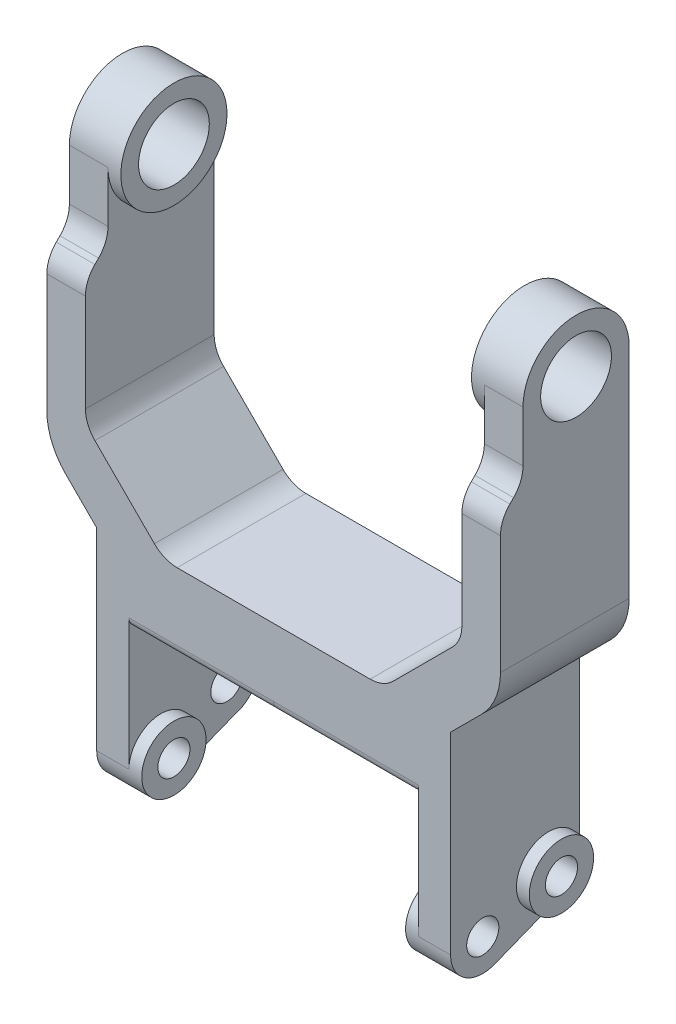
ISO-10303-21;
HEADER;
FILE_DESCRIPTION(('STEP AP214'),'2;1');
FILE_NAME('part.step','',(''),(''),'','','');
FILE_SCHEMA(('AUTOMOTIVE_DESIGN { 1 0 10303 214 1 1 1 1 }'));
ENDSEC;
DATA;
#1=APPLICATION_CONTEXT('core data for automotive mechanical design processes');
#2=APPLICATION_PROTOCOL_DEFINITION('international standard','automotive_design',2000,#1);
#3=PRODUCT_CONTEXT('',#1,'mechanical');
#4=PRODUCT('Part','Part','',(#3));
#5=PRODUCT_RELATED_PRODUCT_CATEGORY('part','',(#4));
#6=PRODUCT_DEFINITION_FORMATION('','',#4);
#7=PRODUCT_DEFINITION_CONTEXT('part definition',#1,'design');
#8=PRODUCT_DEFINITION('design','',#6,#7);
#9=PRODUCT_DEFINITION_SHAPE('','',#8);
#10=(LENGTH_UNIT() NAMED_UNIT(*) SI_UNIT(.MILLI.,.METRE.));
#11=(NAMED_UNIT(*) PLANE_ANGLE_UNIT() SI_UNIT($,.RADIAN.));
#12=(NAMED_UNIT(*) SI_UNIT($,.STERADIAN.) SOLID_ANGLE_UNIT());
#13=UNCERTAINTY_MEASURE_WITH_UNIT(LENGTH_MEASURE(1.E-05),#10,'distance_accuracy_value','');
#14=(GEOMETRIC_REPRESENTATION_CONTEXT(3) GLOBAL_UNCERTAINTY_ASSIGNED_CONTEXT((#13)) GLOBAL_UNIT_ASSIGNED_CONTEXT((#10,
#11,#12)) REPRESENTATION_CONTEXT('',''));
#15=CARTESIAN_POINT('',(0.,0.,0.));
#16=DIRECTION('',(0.,0.,1.));
#17=DIRECTION('',(1.,0.,0.));
#18=AXIS2_PLACEMENT_3D('',#15,#16,#17);
#19=CARTESIAN_POINT('',(-64.642135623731,7.8725830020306,20.));
#20=DIRECTION('',(-0.707106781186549,-0.707106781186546,0.));
#21=DIRECTION('',(0.707106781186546,-0.707106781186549,0.));
#22=AXIS2_PLACEMENT_3D('',#19,#20,#21);
#23=PLANE('',#22);
#24=DIRECTION('',(-0.707106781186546,0.707106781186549,0.));
#25=VECTOR('',#24,1.);
#26=CARTESIAN_POINT('',(-64.642135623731,7.8725830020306,-20.));
#27=LINE('',#26,#25);
#28=CARTESIAN_POINT('',(-55.,-1.76955262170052,-20.));
#29=VERTEX_POINT('',#28);
#30=CARTESIAN_POINT('',(-64.642135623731,7.8725830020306,-20.));
#31=VERTEX_POINT('',#30);
#32=EDGE_CURVE('E451',#29,#31,#27,.T.);
#33=ORIENTED_EDGE('',*,*,#32,.F.);
#34=DIRECTION('',(0.,0.,1.));
#35=VECTOR('',#34,1.);
#36=CARTESIAN_POINT('',(-55.,-1.76955262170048,10.));
#37=LINE('',#36,#35);
#38=CARTESIAN_POINT('',(-55.,-1.76955262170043,20.));
#39=VERTEX_POINT('',#38);
#40=EDGE_CURVE('E349',#29,#39,#37,.T.);
#41=ORIENTED_EDGE('',*,*,#40,.T.);
#42=DIRECTION('',(-0.707106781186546,0.707106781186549,0.));
#43=VECTOR('',#42,1.);
#44=CARTESIAN_POINT('',(-64.642135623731,7.8725830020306,20.));
#45=LINE('',#44,#43);
#46=CARTESIAN_POINT('',(-64.642135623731,7.8725830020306,20.));
#47=VERTEX_POINT('',#46);
#48=EDGE_CURVE('E472',#39,#47,#45,.T.);
#49=ORIENTED_EDGE('',*,*,#48,.T.);
#50=DIRECTION('',(0.,0.,-1.));
#51=VECTOR('',#50,1.);
#52=CARTESIAN_POINT('',(-64.642135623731,7.8725830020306,20.));
#53=LINE('',#52,#51);
#54=EDGE_CURVE('E488',#47,#31,#53,.T.);
#55=ORIENTED_EDGE('',*,*,#54,.T.);
#56=EDGE_LOOP('',(#33,#41,#49,#55));
#57=FACE_BOUND('',#56,.T.);
#58=ADVANCED_FACE('F30',(#57),#23,.T.);
#59=CARTESIAN_POINT('',(-58.5,28.5000000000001,20.));
#60=DIRECTION('',(1.,0.,0.));
#61=DIRECTION('',(0.,1.,0.));
#62=AXIS2_PLACEMENT_3D('',#59,#60,#61);
#63=PLANE('',#62);
#64=DIRECTION('',(0.,-1.,0.));
#65=VECTOR('',#64,1.);
#66=CARTESIAN_POINT('',(-58.5,28.5000000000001,-20.));
#67=LINE('',#66,#65);
#68=CARTESIAN_POINT('',(-58.5,90.,-20.));
#69=VERTEX_POINT('',#68);
#70=CARTESIAN_POINT('',(-58.5,28.5000000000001,-20.));
#71=VERTEX_POINT('',#70);
#72=EDGE_CURVE('E439',#69,#71,#67,.T.);
#73=ORIENTED_EDGE('',*,*,#72,.F.);
#74=CARTESIAN_POINT('',(-58.5,90.,-3.5));
#75=DIRECTION('',(1.,0.,0.));
#76=DIRECTION('',(0.,1.,0.));
#77=AXIS2_PLACEMENT_3D('',#74,#75,#76);
#78=CIRCLE('',#77,16.5);
#79=CARTESIAN_POINT('',(-58.5,90.,13.));
#80=VERTEX_POINT('',#79);
#81=EDGE_CURVE('E397',#69,#80,#78,.F.);
#82=ORIENTED_EDGE('',*,*,#81,.T.);
#83=DIRECTION('',(0.,-1.,0.));
#84=VECTOR('',#83,1.);
#85=CARTESIAN_POINT('',(-58.5,28.5000000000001,13.));
#86=LINE('',#85,#84);
#87=CARTESIAN_POINT('',(-58.5,74.142135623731,13.));
#88=VERTEX_POINT('',#87);
#89=EDGE_CURVE('E416',#80,#88,#86,.T.);
#90=ORIENTED_EDGE('',*,*,#89,.T.);
#91=CARTESIAN_POINT('',(-58.5,74.142135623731,23.));
#92=DIRECTION('',(1.,0.,0.));
#93=DIRECTION('',(0.,1.,0.));
#94=AXIS2_PLACEMENT_3D('',#91,#92,#93);
#95=CIRCLE('',#94,10.);
#96=CARTESIAN_POINT('',(-58.5,67.0710678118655,15.9289321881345));
#97=VERTEX_POINT('',#96);
#98=EDGE_CURVE('E427',#88,#97,#95,.F.);
#99=ORIENTED_EDGE('',*,*,#98,.T.);
#100=DIRECTION('',(0.,-0.707106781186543,0.707106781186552));
#101=VECTOR('',#100,1.);
#102=CARTESIAN_POINT('',(-58.5,45.7500000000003,37.25));
#103=LINE('',#102,#101);
#104=CARTESIAN_POINT('',(-58.5,65.9289321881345,17.0710678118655));
#105=VERTEX_POINT('',#104);
#106=EDGE_CURVE('E430',#97,#105,#103,.T.);
#107=ORIENTED_EDGE('',*,*,#106,.T.);
#108=CARTESIAN_POINT('',(-58.5,58.8578643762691,10.));
#109=DIRECTION('',(1.,0.,0.));
#110=DIRECTION('',(0.,1.,0.));
#111=AXIS2_PLACEMENT_3D('',#108,#109,#110);
#112=CIRCLE('',#111,10.);
#113=CARTESIAN_POINT('',(-58.5,58.8578643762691,20.));
#114=VERTEX_POINT('',#113);
#115=EDGE_CURVE('E433',#105,#114,#112,.T.);
#116=ORIENTED_EDGE('',*,*,#115,.T.);
#117=DIRECTION('',(0.,-1.,0.));
#118=VECTOR('',#117,1.);
#119=CARTESIAN_POINT('',(-58.5,28.5000000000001,20.));
#120=LINE('',#119,#118);
#121=CARTESIAN_POINT('',(-58.5,28.5000000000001,20.));
#122=VERTEX_POINT('',#121);
#123=EDGE_CURVE('E465',#114,#122,#120,.T.);
#124=ORIENTED_EDGE('',*,*,#123,.T.);
#125=DIRECTION('',(0.,0.,-1.));
#126=VECTOR('',#125,1.);
#127=CARTESIAN_POINT('',(-58.5,28.5000000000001,20.));
#128=LINE('',#127,#126);
#129=EDGE_CURVE('E493',#122,#71,#128,.T.);
#130=ORIENTED_EDGE('',*,*,#129,.T.);
#131=EDGE_LOOP('',(#73,#82,#90,#99,#107,#116,#124,#130));
#132=FACE_BOUND('',#131,.T.);
#133=ADVANCED_FACE('F755',(#132),#63,.T.);
#134=CARTESIAN_POINT('',(48.5,28.5000000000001,20.));
#135=DIRECTION('',(0.,0.,1.));
#136=DIRECTION('',(1.,0.,0.));
#137=AXIS2_PLACEMENT_3D('',#134,#135,#136);
#138=PLANE('',#137);
#139=ORIENTED_EDGE('',*,*,#48,.F.);
#140=DIRECTION('',(0.,1.,0.));
#141=VECTOR('',#140,1.);
#142=CARTESIAN_POINT('',(-55.,-1.76955262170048,20.));
#143=LINE('',#142,#141);
#144=CARTESIAN_POINT('',(-55.,-61.7695526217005,20.));
#145=VERTEX_POINT('',#144);
#146=EDGE_CURVE('E47',#145,#39,#143,.T.);
#147=ORIENTED_EDGE('',*,*,#146,.F.);
#148=DIRECTION('',(-1.,0.,0.));
#149=VECTOR('',#148,1.);
#150=CARTESIAN_POINT('',(-45.,-61.7695526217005,20.));
#151=LINE('',#150,#149);
#152=CARTESIAN_POINT('',(-45.,-61.7695526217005,20.));
#153=VERTEX_POINT('',#152);
#154=EDGE_CURVE('E373',#153,#145,#151,.T.);
#155=ORIENTED_EDGE('',*,*,#154,.F.);
#156=DIRECTION('',(0.,-1.,0.));
#157=VECTOR('',#156,1.);
#158=CARTESIAN_POINT('',(-45.,-1.7695526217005,20.));
#159=LINE('',#158,#157);
#160=CARTESIAN_POINT('',(-45.,-21.,20.));
#161=VERTEX_POINT('',#160);
#162=EDGE_CURVE('E364',#161,#153,#159,.T.);
#163=ORIENTED_EDGE('',*,*,#162,.F.);
#164=DIRECTION('',(-1.,0.,0.));
#165=VECTOR('',#164,1.);
#166=CARTESIAN_POINT('',(48.5,-21.,20.));
#167=LINE('',#166,#165);
#168=CARTESIAN_POINT('',(0.,-21.,20.));
#169=VERTEX_POINT('',#168);
#170=EDGE_CURVE('E691',#161,#169,#167,.F.);
#171=ORIENTED_EDGE('',*,*,#170,.T.);
#172=DIRECTION('',(1.,0.,0.));
#173=VECTOR('',#172,1.);
#174=CARTESIAN_POINT('',(48.5,-21.,20.));
#175=LINE('',#174,#173);
#176=CARTESIAN_POINT('',(45.,-21.,20.));
#177=VERTEX_POINT('',#176);
#178=EDGE_CURVE('E664',#169,#177,#175,.T.);
#179=ORIENTED_EDGE('',*,*,#178,.T.);
#180=DIRECTION('',(0.,-1.,0.));
#181=VECTOR('',#180,1.);
#182=CARTESIAN_POINT('',(45.,-1.7695526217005,20.));
#183=LINE('',#182,#181);
#184=CARTESIAN_POINT('',(45.,-61.7695526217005,20.));
#185=VERTEX_POINT('',#184);
#186=EDGE_CURVE('E519',#177,#185,#183,.T.);
#187=ORIENTED_EDGE('',*,*,#186,.T.);
#188=DIRECTION('',(1.,0.,0.));
#189=VECTOR('',#188,1.);
#190=CARTESIAN_POINT('',(45.,-61.7695526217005,20.));
#191=LINE('',#190,#189);
#192=CARTESIAN_POINT('',(55.,-61.7695526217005,20.));
#193=VERTEX_POINT('',#192);
#194=EDGE_CURVE('E531',#185,#193,#191,.T.);
#195=ORIENTED_EDGE('',*,*,#194,.T.);
#196=DIRECTION('',(0.,1.,0.));
#197=VECTOR('',#196,1.);
#198=CARTESIAN_POINT('',(55.,-1.76955262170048,20.));
#199=LINE('',#198,#197);
#200=CARTESIAN_POINT('',(55.,-1.76955262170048,20.));
#201=VERTEX_POINT('',#200);
#202=EDGE_CURVE('E549',#193,#201,#199,.T.);
#203=ORIENTED_EDGE('',*,*,#202,.T.);
#204=DIRECTION('',(0.707106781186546,0.707106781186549,0.));
#205=VECTOR('',#204,1.);
#206=CARTESIAN_POINT('',(64.642135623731,7.8725830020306,20.));
#207=LINE('',#206,#205);
#208=CARTESIAN_POINT('',(64.642135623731,7.8725830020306,20.));
#209=VERTEX_POINT('',#208);
#210=EDGE_CURVE('E623',#201,#209,#207,.T.);
#211=ORIENTED_EDGE('',*,*,#210,.T.);
#212=CARTESIAN_POINT('',(50.5,22.0147186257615,20.));
#213=DIRECTION('',(0.,0.,1.));
#214=DIRECTION('',(-1.,0.,0.));
#215=AXIS2_PLACEMENT_3D('',#212,#213,#214);
#216=CIRCLE('',#215,20.);
#217=CARTESIAN_POINT('',(70.5,22.0147186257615,20.));
#218=VERTEX_POINT('',#217);
#219=EDGE_CURVE('E625',#209,#218,#216,.T.);
#220=ORIENTED_EDGE('',*,*,#219,.T.);
#221=DIRECTION('',(0.,1.,0.));
#222=VECTOR('',#221,1.);
#223=CARTESIAN_POINT('',(70.5,90.,20.));
#224=LINE('',#223,#222);
#225=CARTESIAN_POINT('',(70.5,58.8578643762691,20.));
#226=VERTEX_POINT('',#225);
#227=EDGE_CURVE('E627',#218,#226,#224,.T.);
#228=ORIENTED_EDGE('',*,*,#227,.T.);
#229=DIRECTION('',(1.,0.,0.));
#230=VECTOR('',#229,1.);
#231=CARTESIAN_POINT('',(0.,58.8578643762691,20.));
#232=LINE('',#231,#230);
#233=CARTESIAN_POINT('',(58.5,58.857864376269,20.));
#234=VERTEX_POINT('',#233);
#235=EDGE_CURVE('E652',#226,#234,#232,.F.);
#236=ORIENTED_EDGE('',*,*,#235,.T.);
#237=DIRECTION('',(0.,-1.,0.));
#238=VECTOR('',#237,1.);
#239=CARTESIAN_POINT('',(58.5,28.5000000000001,20.));
#240=LINE('',#239,#238);
#241=CARTESIAN_POINT('',(58.5,28.5000000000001,20.));
#242=VERTEX_POINT('',#241);
#243=EDGE_CURVE('E630',#234,#242,#240,.T.);
#244=ORIENTED_EDGE('',*,*,#243,.T.);
#245=CARTESIAN_POINT('',(48.5,28.5000000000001,20.));
#246=DIRECTION('',(0.,0.,-1.));
#247=DIRECTION('',(1.,0.,0.));
#248=AXIS2_PLACEMENT_3D('',#245,#246,#247);
#249=CIRCLE('',#248,10.);
#250=CARTESIAN_POINT('',(55.5710678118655,21.4289321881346,20.));
#251=VERTEX_POINT('',#250);
#252=EDGE_CURVE('E614',#242,#251,#249,.T.);
#253=ORIENTED_EDGE('',*,*,#252,.T.);
#254=DIRECTION('',(-0.707106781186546,-0.707106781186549,0.));
#255=VECTOR('',#254,1.);
#256=CARTESIAN_POINT('',(37.0710678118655,2.92893218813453,20.));
#257=LINE('',#256,#255);
#258=CARTESIAN_POINT('',(37.0710678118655,2.92893218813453,20.));
#259=VERTEX_POINT('',#258);
#260=EDGE_CURVE('E617',#251,#259,#257,.T.);
#261=ORIENTED_EDGE('',*,*,#260,.T.);
#262=CARTESIAN_POINT('',(30.,9.99999999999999,20.));
#263=DIRECTION('',(0.,0.,-1.));
#264=DIRECTION('',(1.,0.,0.));
#265=AXIS2_PLACEMENT_3D('',#262,#263,#264);
#266=CIRCLE('',#265,10.);
#267=CARTESIAN_POINT('',(30.,0.,20.));
#268=VERTEX_POINT('',#267);
#269=EDGE_CURVE('E619',#259,#268,#266,.T.);
#270=ORIENTED_EDGE('',*,*,#269,.T.);
#271=DIRECTION('',(-1.,0.,0.));
#272=VECTOR('',#271,1.);
#273=CARTESIAN_POINT('',(0.,0.,20.));
#274=LINE('',#273,#272);
#275=CARTESIAN_POINT('',(-30.,0.,20.));
#276=VERTEX_POINT('',#275);
#277=EDGE_CURVE('E621',#268,#276,#274,.T.);
#278=ORIENTED_EDGE('',*,*,#277,.T.);
#279=CARTESIAN_POINT('',(-30.,9.99999999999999,20.));
#280=DIRECTION('',(0.,0.,1.));
#281=DIRECTION('',(-1.,0.,0.));
#282=AXIS2_PLACEMENT_3D('',#279,#280,#281);
#283=CIRCLE('',#282,10.);
#284=CARTESIAN_POINT('',(-37.0710678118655,2.92893218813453,20.));
#285=VERTEX_POINT('',#284);
#286=EDGE_CURVE('E474',#285,#276,#283,.T.);
#287=ORIENTED_EDGE('',*,*,#286,.F.);
#288=DIRECTION('',(0.707106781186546,-0.707106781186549,0.));
#289=VECTOR('',#288,1.);
#290=CARTESIAN_POINT('',(-37.0710678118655,2.92893218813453,20.));
#291=LINE('',#290,#289);
#292=CARTESIAN_POINT('',(-55.5710678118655,21.4289321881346,20.));
#293=VERTEX_POINT('',#292);
#294=EDGE_CURVE('E477',#293,#285,#291,.T.);
#295=ORIENTED_EDGE('',*,*,#294,.F.);
#296=CARTESIAN_POINT('',(-48.5,28.5000000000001,20.));
#297=DIRECTION('',(0.,0.,1.));
#298=DIRECTION('',(-1.,0.,0.));
#299=AXIS2_PLACEMENT_3D('',#296,#297,#298);
#300=CIRCLE('',#299,10.);
#301=EDGE_CURVE('E462',#122,#293,#300,.T.);
#302=ORIENTED_EDGE('',*,*,#301,.F.);
#303=ORIENTED_EDGE('',*,*,#123,.F.);
#304=DIRECTION('',(-1.,0.,0.));
#305=VECTOR('',#304,1.);
#306=CARTESIAN_POINT('',(70.5,58.8578643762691,20.));
#307=LINE('',#306,#305);
#308=CARTESIAN_POINT('',(-70.5,58.8578643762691,20.));
#309=VERTEX_POINT('',#308);
#310=EDGE_CURVE('E413',#114,#309,#307,.T.);
#311=ORIENTED_EDGE('',*,*,#310,.T.);
#312=DIRECTION('',(0.,1.,0.));
#313=VECTOR('',#312,1.);
#314=CARTESIAN_POINT('',(-70.5,90.,20.));
#315=LINE('',#314,#313);
#316=CARTESIAN_POINT('',(-70.5,22.0147186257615,20.));
#317=VERTEX_POINT('',#316);
#318=EDGE_CURVE('E467',#317,#309,#315,.T.);
#319=ORIENTED_EDGE('',*,*,#318,.F.);
#320=CARTESIAN_POINT('',(-50.5,22.0147186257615,20.));
#321=DIRECTION('',(0.,0.,-1.));
#322=DIRECTION('',(1.,0.,0.));
#323=AXIS2_PLACEMENT_3D('',#320,#321,#322);
#324=CIRCLE('',#323,20.);
#325=EDGE_CURVE('E470',#47,#317,#324,.T.);
#326=ORIENTED_EDGE('',*,*,#325,.F.);
#327=EDGE_LOOP('',(#139,#147,#155,#163,#171,#179,#187,#195,#203,#211,#220,#228,#236,#244,#253,
#261,#270,#278,#287,#295,#302,#303,#311,#319,#326));
#328=FACE_BOUND('',#327,.T.);
#329=ADVANCED_FACE('F761',(#328),#138,.T.);
#330=CARTESIAN_POINT('',(-70.5,90.,20.));
#331=DIRECTION('',(-1.,0.,0.));
#332=DIRECTION('',(0.,0.,1.));
#333=AXIS2_PLACEMENT_3D('',#330,#331,#332);
#334=PLANE('',#333);
#335=CARTESIAN_POINT('',(-70.5,90.,-3.5));
#336=DIRECTION('',(1.,0.,0.));
#337=DIRECTION('',(0.,0.,-1.));
#338=AXIS2_PLACEMENT_3D('',#335,#336,#337);
#339=CIRCLE('',#338,11.);
#340=CARTESIAN_POINT('',(-70.5,90.,-14.5));
#341=VERTEX_POINT('',#340);
#342=EDGE_CURVE('E713',#341,#341,#339,.T.);
#343=ORIENTED_EDGE('',*,*,#342,.T.);
#344=EDGE_LOOP('',(#343));
#345=FACE_BOUND('',#344,.T.);
#346=DIRECTION('',(0.,1.,0.));
#347=VECTOR('',#346,1.);
#348=CARTESIAN_POINT('',(-70.5,90.,13.));
#349=LINE('',#348,#347);
#350=CARTESIAN_POINT('',(-70.5,74.142135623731,13.));
#351=VERTEX_POINT('',#350);
#352=CARTESIAN_POINT('',(-70.5,90.,13.));
#353=VERTEX_POINT('',#352);
#354=EDGE_CURVE('E400',#351,#353,#349,.T.);
#355=ORIENTED_EDGE('',*,*,#354,.T.);
#356=CARTESIAN_POINT('',(-70.5,90.,-3.5));
#357=DIRECTION('',(1.,0.,0.));
#358=DIRECTION('',(0.,0.,-1.));
#359=AXIS2_PLACEMENT_3D('',#356,#357,#358);
#360=CIRCLE('',#359,16.5);
#361=CARTESIAN_POINT('',(-70.5,90.,-20.));
#362=VERTEX_POINT('',#361);
#363=EDGE_CURVE('E392',#362,#353,#360,.T.);
#364=ORIENTED_EDGE('',*,*,#363,.F.);
#365=DIRECTION('',(0.,1.,0.));
#366=VECTOR('',#365,1.);
#367=CARTESIAN_POINT('',(-70.5,90.,-20.));
#368=LINE('',#367,#366);
#369=CARTESIAN_POINT('',(-70.5,22.0147186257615,-20.));
#370=VERTEX_POINT('',#369);
#371=EDGE_CURVE('E445',#370,#362,#368,.T.);
#372=ORIENTED_EDGE('',*,*,#371,.F.);
#373=DIRECTION('',(0.,0.,-1.));
#374=VECTOR('',#373,1.);
#375=CARTESIAN_POINT('',(-70.5,22.0147186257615,20.));
#376=LINE('',#375,#374);
#377=EDGE_CURVE('E491',#317,#370,#376,.T.);
#378=ORIENTED_EDGE('',*,*,#377,.F.);
#379=ORIENTED_EDGE('',*,*,#318,.T.);
#380=CARTESIAN_POINT('',(-70.5,58.8578643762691,10.));
#381=DIRECTION('',(-1.,0.,0.));
#382=DIRECTION('',(0.,0.,-1.));
#383=AXIS2_PLACEMENT_3D('',#380,#381,#382);
#384=CIRCLE('',#383,10.);
#385=CARTESIAN_POINT('',(-70.5,65.9289321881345,17.0710678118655));
#386=VERTEX_POINT('',#385);
#387=EDGE_CURVE('E409',#309,#386,#384,.T.);
#388=ORIENTED_EDGE('',*,*,#387,.T.);
#389=DIRECTION('',(0.,0.707106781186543,-0.707106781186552));
#390=VECTOR('',#389,1.);
#391=CARTESIAN_POINT('',(-70.5,67.0710678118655,15.9289321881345));
#392=LINE('',#391,#390);
#393=CARTESIAN_POINT('',(-70.5,67.0710678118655,15.9289321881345));
#394=VERTEX_POINT('',#393);
#395=EDGE_CURVE('E406',#386,#394,#392,.T.);
#396=ORIENTED_EDGE('',*,*,#395,.T.);
#397=CARTESIAN_POINT('',(-70.5,74.142135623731,23.));
#398=DIRECTION('',(1.,0.,0.));
#399=DIRECTION('',(0.,0.,1.));
#400=AXIS2_PLACEMENT_3D('',#397,#398,#399);
#401=CIRCLE('',#400,10.);
#402=EDGE_CURVE('E403',#394,#351,#401,.T.);
#403=ORIENTED_EDGE('',*,*,#402,.T.);
#404=EDGE_LOOP('',(#355,#364,#372,#378,#379,#388,#396,#403));
#405=FACE_BOUND('',#404,.T.);
#406=ADVANCED_FACE('F773',(#345,#405),#334,.T.);
#407=CARTESIAN_POINT('',(55.,-1.76955262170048,10.));
#408=DIRECTION('',(1.,0.,0.));
#409=DIRECTION('',(0.,0.,-1.));
#410=AXIS2_PLACEMENT_3D('',#407,#408,#409);
#411=PLANE('',#410);
#412=CARTESIAN_POINT('',(55.,-61.7695526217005,9.99999999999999));
#413=DIRECTION('',(1.,0.,0.));
#414=DIRECTION('',(0.,0.,-1.));
#415=AXIS2_PLACEMENT_3D('',#412,#413,#414);
#416=CIRCLE('',#415,5.);
#417=CARTESIAN_POINT('',(55.,-61.7695526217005,4.99999999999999));
#418=VERTEX_POINT('',#417);
#419=EDGE_CURVE('E698',#418,#418,#416,.T.);
#420=ORIENTED_EDGE('',*,*,#419,.F.);
#421=EDGE_LOOP('',(#420));
#422=FACE_BOUND('',#421,.T.);
#423=DIRECTION('',(0.,0.367517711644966,-0.930016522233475));
#424=VECTOR('',#423,1.);
#425=CARTESIAN_POINT('',(55.,-71.0697178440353,6.32482288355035));
#426=LINE('',#425,#424);
#427=CARTESIAN_POINT('',(55.,-71.0697178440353,6.32482288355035));
#428=VERTEX_POINT('',#427);
#429=CARTESIAN_POINT('',(55.,-63.4582889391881,-12.9361662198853));
#430=VERTEX_POINT('',#429);
#431=EDGE_CURVE('E512',#428,#430,#426,.T.);
#432=ORIENTED_EDGE('',*,*,#431,.T.);
#433=CARTESIAN_POINT('',(55.,-53.7695526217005,-10.4606079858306));
#434=DIRECTION('',(1.,0.,0.));
#435=DIRECTION('',(0.,0.,-1.));
#436=AXIS2_PLACEMENT_3D('',#433,#434,#435);
#437=CIRCLE('',#436,10.);
#438=CARTESIAN_POINT('',(55.,-50.7695526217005,-20.));
#439=VERTEX_POINT('',#438);
#440=EDGE_CURVE('E496',#439,#430,#437,.T.);
#441=ORIENTED_EDGE('',*,*,#440,.F.);
#442=DIRECTION('',(0.,1.,0.));
#443=VECTOR('',#442,1.);
#444=CARTESIAN_POINT('',(55.,-1.76955262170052,-20.));
#445=LINE('',#444,#443);
#446=CARTESIAN_POINT('',(55.,-1.76955262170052,-20.));
#447=VERTEX_POINT('',#446);
#448=EDGE_CURVE('E515',#439,#447,#445,.T.);
#449=ORIENTED_EDGE('',*,*,#448,.T.);
#450=DIRECTION('',(0.,0.,1.));
#451=VECTOR('',#450,1.);
#452=CARTESIAN_POINT('',(55.,-1.76955262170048,10.));
#453=LINE('',#452,#451);
#454=EDGE_CURVE('E554',#447,#201,#453,.T.);
#455=ORIENTED_EDGE('',*,*,#454,.T.);
#456=ORIENTED_EDGE('',*,*,#202,.F.);
#457=CARTESIAN_POINT('',(55.,-61.7695526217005,9.99999999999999));
#458=DIRECTION('',(1.,0.,0.));
#459=DIRECTION('',(0.,0.,1.));
#460=AXIS2_PLACEMENT_3D('',#457,#458,#459);
#461=CIRCLE('',#460,10.);
#462=EDGE_CURVE('E508',#193,#428,#461,.T.);
#463=ORIENTED_EDGE('',*,*,#462,.T.);
#464=EDGE_LOOP('',(#432,#441,#449,#455,#456,#463));
#465=FACE_BOUND('',#464,.T.);
#466=ADVANCED_FACE('F775',(#422,#465),#411,.T.);
#467=CARTESIAN_POINT('',(45.,-61.7695526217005,9.99999999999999));
#468=DIRECTION('',(-1.,0.,0.));
#469=DIRECTION('',(0.,0.,1.));
#470=AXIS2_PLACEMENT_3D('',#467,#468,#469);
#471=PLANE('',#470);
#472=CARTESIAN_POINT('',(45.,-53.7695526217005,-10.4606079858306));
#473=DIRECTION('',(-1.,0.,0.));
#474=DIRECTION('',(0.,0.,1.));
#475=AXIS2_PLACEMENT_3D('',#472,#473,#474);
#476=CIRCLE('',#475,5.);
#477=CARTESIAN_POINT('',(45.,-53.7695526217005,-5.46060798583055));
#478=VERTEX_POINT('',#477);
#479=EDGE_CURVE('E335',#478,#478,#476,.T.);
#480=ORIENTED_EDGE('',*,*,#479,.F.);
#481=EDGE_LOOP('',(#480));
#482=FACE_BOUND('',#481,.T.);
#483=DIRECTION('',(0.,0.367517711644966,-0.930016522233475));
#484=VECTOR('',#483,1.);
#485=CARTESIAN_POINT('',(45.,-71.0697178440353,6.32482288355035));
#486=LINE('',#485,#484);
#487=CARTESIAN_POINT('',(45.,-71.0697178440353,6.32482288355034));
#488=VERTEX_POINT('',#487);
#489=CARTESIAN_POINT('',(45.,-62.533267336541,-15.2769659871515));
#490=VERTEX_POINT('',#489);
#491=EDGE_CURVE('E522',#488,#490,#486,.T.);
#492=ORIENTED_EDGE('',*,*,#491,.F.);
#493=CARTESIAN_POINT('',(45.,-61.7695526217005,9.99999999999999));
#494=DIRECTION('',(-1.,0.,0.));
#495=DIRECTION('',(0.,0.,1.));
#496=AXIS2_PLACEMENT_3D('',#493,#494,#495);
#497=CIRCLE('',#496,10.);
#498=EDGE_CURVE('E503',#185,#488,#497,.T.);
#499=ORIENTED_EDGE('',*,*,#498,.F.);
#500=ORIENTED_EDGE('',*,*,#186,.F.);
#501=CARTESIAN_POINT('',(45.,-21.,17.));
#502=DIRECTION('',(-1.,0.,0.));
#503=DIRECTION('',(0.,0.,1.));
#504=AXIS2_PLACEMENT_3D('',#501,#502,#503);
#505=CIRCLE('',#504,3.);
#506=CARTESIAN_POINT('',(45.,-24.,17.));
#507=VERTEX_POINT('',#506);
#508=EDGE_CURVE('E547',#177,#507,#505,.F.);
#509=ORIENTED_EDGE('',*,*,#508,.T.);
#510=DIRECTION('',(0.,0.,-1.));
#511=VECTOR('',#510,1.);
#512=CARTESIAN_POINT('',(45.,-24.,10.));
#513=LINE('',#512,#511);
#514=CARTESIAN_POINT('',(45.,-24.,13.));
#515=VERTEX_POINT('',#514);
#516=EDGE_CURVE('E534',#507,#515,#513,.T.);
#517=ORIENTED_EDGE('',*,*,#516,.T.);
#518=CARTESIAN_POINT('',(45.,-21.,13.));
#519=DIRECTION('',(-1.,0.,0.));
#520=DIRECTION('',(0.,0.,1.));
#521=AXIS2_PLACEMENT_3D('',#518,#519,#520);
#522=CIRCLE('',#521,3.);
#523=CARTESIAN_POINT('',(45.,-21.,10.));
#524=VERTEX_POINT('',#523);
#525=EDGE_CURVE('E680',#515,#524,#522,.F.);
#526=ORIENTED_EDGE('',*,*,#525,.T.);
#527=DIRECTION('',(0.,1.,0.));
#528=VECTOR('',#527,1.);
#529=CARTESIAN_POINT('',(45.,4.,10.));
#530=LINE('',#529,#528);
#531=CARTESIAN_POINT('',(45.,-11.6006992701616,10.));
#532=VERTEX_POINT('',#531);
#533=EDGE_CURVE('E542',#524,#532,#530,.T.);
#534=ORIENTED_EDGE('',*,*,#533,.T.);
#535=DIRECTION('',(0.,0.,-1.));
#536=VECTOR('',#535,1.);
#537=CARTESIAN_POINT('',(45.,-11.6006992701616,20.));
#538=LINE('',#537,#536);
#539=CARTESIAN_POINT('',(45.,-11.6006992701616,-20.));
#540=VERTEX_POINT('',#539);
#541=EDGE_CURVE('E544',#540,#532,#538,.F.);
#542=ORIENTED_EDGE('',*,*,#541,.F.);
#543=DIRECTION('',(0.,1.,0.));
#544=VECTOR('',#543,1.);
#545=CARTESIAN_POINT('',(45.,-1.76955262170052,-20.));
#546=LINE('',#545,#544);
#547=CARTESIAN_POINT('',(45.,-56.7695526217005,-20.));
#548=VERTEX_POINT('',#547);
#549=EDGE_CURVE('E528',#548,#540,#546,.T.);
#550=ORIENTED_EDGE('',*,*,#549,.F.);
#551=CARTESIAN_POINT('',(45.,-53.7695526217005,-10.4606079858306));
#552=DIRECTION('',(1.,0.,0.));
#553=DIRECTION('',(0.,0.,1.));
#554=AXIS2_PLACEMENT_3D('',#551,#552,#553);
#555=CIRCLE('',#554,10.);
#556=EDGE_CURVE('E525',#490,#548,#555,.T.);
#557=ORIENTED_EDGE('',*,*,#556,.F.);
#558=EDGE_LOOP('',(#492,#499,#500,#509,#517,#526,#534,#542,#550,#557));
#559=FACE_BOUND('',#558,.T.);
#560=ADVANCED_FACE('F795',(#482,#559),#471,.T.);
#561=CARTESIAN_POINT('',(64.642135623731,7.8725830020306,20.));
#562=DIRECTION('',(-0.707106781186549,0.707106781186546,0.));
#563=DIRECTION('',(-0.707106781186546,-0.707106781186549,0.));
#564=AXIS2_PLACEMENT_3D('',#561,#562,#563);
#565=PLANE('',#564);
#566=ORIENTED_EDGE('',*,*,#454,.F.);
#567=DIRECTION('',(0.707106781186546,0.707106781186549,0.));
#568=VECTOR('',#567,1.);
#569=CARTESIAN_POINT('',(64.642135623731,7.8725830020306,-20.));
#570=LINE('',#569,#568);
#571=CARTESIAN_POINT('',(64.642135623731,7.8725830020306,-20.));
#572=VERTEX_POINT('',#571);
#573=EDGE_CURVE('E603',#447,#572,#570,.T.);
#574=ORIENTED_EDGE('',*,*,#573,.T.);
#575=DIRECTION('',(0.,0.,-1.));
#576=VECTOR('',#575,1.);
#577=CARTESIAN_POINT('',(64.642135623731,7.8725830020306,20.));
#578=LINE('',#577,#576);
#579=EDGE_CURVE('E638',#209,#572,#578,.T.);
#580=ORIENTED_EDGE('',*,*,#579,.F.);
#581=ORIENTED_EDGE('',*,*,#210,.F.);
#582=EDGE_LOOP('',(#566,#574,#580,#581));
#583=FACE_BOUND('',#582,.T.);
#584=ADVANCED_FACE('F798',(#583),#565,.F.);
#585=CARTESIAN_POINT('',(48.5,28.5000000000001,20.));
#586=DIRECTION('',(0.,0.,-1.));
#587=DIRECTION('',(-1.,0.,0.));
#588=AXIS2_PLACEMENT_3D('',#585,#586,#587);
#589=CYLINDRICAL_SURFACE('',#588,10.);
#590=CARTESIAN_POINT('',(48.5,28.5000000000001,-20.));
#591=DIRECTION('',(0.,0.,-1.));
#592=DIRECTION('',(1.,0.,0.));
#593=AXIS2_PLACEMENT_3D('',#590,#591,#592);
#594=CIRCLE('',#593,10.);
#595=CARTESIAN_POINT('',(58.5,28.5000000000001,-20.));
#596=VERTEX_POINT('',#595);
#597=CARTESIAN_POINT('',(55.5710678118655,21.4289321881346,-20.));
#598=VERTEX_POINT('',#597);
#599=EDGE_CURVE('E588',#596,#598,#594,.T.);
#600=ORIENTED_EDGE('',*,*,#599,.T.);
#601=DIRECTION('',(0.,0.,-1.));
#602=VECTOR('',#601,1.);
#603=CARTESIAN_POINT('',(55.5710678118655,21.4289321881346,20.));
#604=LINE('',#603,#602);
#605=EDGE_CURVE('E649',#251,#598,#604,.T.);
#606=ORIENTED_EDGE('',*,*,#605,.F.);
#607=ORIENTED_EDGE('',*,*,#252,.F.);
#608=DIRECTION('',(0.,0.,-1.));
#609=VECTOR('',#608,1.);
#610=CARTESIAN_POINT('',(58.5,28.5000000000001,20.));
#611=LINE('',#610,#609);
#612=EDGE_CURVE('E632',#242,#596,#611,.T.);
#613=ORIENTED_EDGE('',*,*,#612,.T.);
#614=EDGE_LOOP('',(#600,#606,#607,#613));
#615=FACE_BOUND('',#614,.T.);
#616=ADVANCED_FACE('F32',(#615),#589,.F.);
#617=CARTESIAN_POINT('',(37.0710678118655,2.92893218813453,20.));
#618=DIRECTION('',(0.707106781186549,-0.707106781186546,0.));
#619=DIRECTION('',(0.707106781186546,0.707106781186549,0.));
#620=AXIS2_PLACEMENT_3D('',#617,#618,#619);
#621=PLANE('',#620);
#622=DIRECTION('',(-0.707106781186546,-0.707106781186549,0.));
#623=VECTOR('',#622,1.);
#624=CARTESIAN_POINT('',(37.0710678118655,2.92893218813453,-20.));
#625=LINE('',#624,#623);
#626=CARTESIAN_POINT('',(37.0710678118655,2.92893218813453,-20.));
#627=VERTEX_POINT('',#626);
#628=EDGE_CURVE('E591',#598,#627,#625,.T.);
#629=ORIENTED_EDGE('',*,*,#628,.T.);
#630=DIRECTION('',(0.,0.,-1.));
#631=VECTOR('',#630,1.);
#632=CARTESIAN_POINT('',(37.0710678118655,2.92893218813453,20.));
#633=LINE('',#632,#631);
#634=EDGE_CURVE('E646',#259,#627,#633,.T.);
#635=ORIENTED_EDGE('',*,*,#634,.F.);
#636=ORIENTED_EDGE('',*,*,#260,.F.);
#637=ORIENTED_EDGE('',*,*,#605,.T.);
#638=EDGE_LOOP('',(#629,#635,#636,#637));
#639=FACE_BOUND('',#638,.T.);
#640=ADVANCED_FACE('F886',(#639),#621,.F.);
#641=CARTESIAN_POINT('',(30.,9.99999999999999,20.));
#642=DIRECTION('',(0.,0.,-1.));
#643=DIRECTION('',(-1.,0.,0.));
#644=AXIS2_PLACEMENT_3D('',#641,#642,#643);
#645=CYLINDRICAL_SURFACE('',#644,10.);
#646=CARTESIAN_POINT('',(30.,9.99999999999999,-20.));
#647=DIRECTION('',(0.,0.,-1.));
#648=DIRECTION('',(1.,0.,0.));
#649=AXIS2_PLACEMENT_3D('',#646,#647,#648);
#650=CIRCLE('',#649,10.);
#651=CARTESIAN_POINT('',(30.,0.,-20.));
#652=VERTEX_POINT('',#651);
#653=EDGE_CURVE('E593',#627,#652,#650,.T.);
#654=ORIENTED_EDGE('',*,*,#653,.T.);
#655=DIRECTION('',(0.,0.,-1.));
#656=VECTOR('',#655,1.);
#657=CARTESIAN_POINT('',(30.,0.,20.));
#658=LINE('',#657,#656);
#659=EDGE_CURVE('E643',#268,#652,#658,.T.);
#660=ORIENTED_EDGE('',*,*,#659,.F.);
#661=ORIENTED_EDGE('',*,*,#269,.F.);
#662=ORIENTED_EDGE('',*,*,#634,.T.);
#663=EDGE_LOOP('',(#654,#660,#661,#662));
#664=FACE_BOUND('',#663,.T.);
#665=ADVANCED_FACE('F883',(#664),#645,.F.);
#666=CARTESIAN_POINT('',(0.,0.,20.));
#667=DIRECTION('',(0.,-1.,0.));
#668=DIRECTION('',(0.,0.,-1.));
#669=AXIS2_PLACEMENT_3D('',#666,#667,#668);
#670=PLANE('',#669);
#671=DIRECTION('',(-1.,0.,0.));
#672=VECTOR('',#671,1.);
#673=CARTESIAN_POINT('',(0.,0.,-20.));
#674=LINE('',#673,#672);
#675=CARTESIAN_POINT('',(-30.,0.,-20.));
#676=VERTEX_POINT('',#675);
#677=EDGE_CURVE('E595',#652,#676,#674,.T.);
#678=ORIENTED_EDGE('',*,*,#677,.T.);
#679=DIRECTION('',(0.,0.,-1.));
#680=VECTOR('',#679,1.);
#681=CARTESIAN_POINT('',(-30.,0.,20.));
#682=LINE('',#681,#680);
#683=EDGE_CURVE('E483',#276,#676,#682,.T.);
#684=ORIENTED_EDGE('',*,*,#683,.F.);
#685=ORIENTED_EDGE('',*,*,#277,.F.);
#686=ORIENTED_EDGE('',*,*,#659,.T.);
#687=EDGE_LOOP('',(#678,#684,#685,#686));
#688=FACE_BOUND('',#687,.T.);
#689=ADVANCED_FACE('F879',(#688),#670,.F.);
#690=CARTESIAN_POINT('',(32.4852813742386,-16.,20.));
#691=DIRECTION('',(0.,1.,0.));
#692=DIRECTION('',(-1.,0.,0.));
#693=AXIS2_PLACEMENT_3D('',#690,#691,#692);
#694=PLANE('',#693);
#695=DIRECTION('',(-1.,0.,0.));
#696=VECTOR('',#695,1.);
#697=CARTESIAN_POINT('',(0.,-16.,10.));
#698=LINE('',#697,#696);
#699=CARTESIAN_POINT('',(32.4852813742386,-16.,10.));
#700=VERTEX_POINT('',#699);
#701=CARTESIAN_POINT('',(-32.4852813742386,-16.,10.));
#702=VERTEX_POINT('',#701);
#703=EDGE_CURVE('E553',#700,#702,#698,.T.);
#704=ORIENTED_EDGE('',*,*,#703,.T.);
#705=DIRECTION('',(0.,0.,-1.));
#706=VECTOR('',#705,1.);
#707=CARTESIAN_POINT('',(-32.4852813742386,-16.,20.));
#708=LINE('',#707,#706);
#709=CARTESIAN_POINT('',(-32.4852813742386,-16.,-20.));
#710=VERTEX_POINT('',#709);
#711=EDGE_CURVE('E486',#702,#710,#708,.T.);
#712=ORIENTED_EDGE('',*,*,#711,.T.);
#713=DIRECTION('',(1.,0.,0.));
#714=VECTOR('',#713,1.);
#715=CARTESIAN_POINT('',(32.4852813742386,-16.,-20.));
#716=LINE('',#715,#714);
#717=CARTESIAN_POINT('',(32.4852813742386,-16.,-20.));
#718=VERTEX_POINT('',#717);
#719=EDGE_CURVE('E597',#710,#718,#716,.T.);
#720=ORIENTED_EDGE('',*,*,#719,.T.);
#721=DIRECTION('',(0.,0.,-1.));
#722=VECTOR('',#721,1.);
#723=CARTESIAN_POINT('',(32.4852813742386,-16.,20.));
#724=LINE('',#723,#722);
#725=EDGE_CURVE('E641',#700,#718,#724,.T.);
#726=ORIENTED_EDGE('',*,*,#725,.F.);
#727=EDGE_LOOP('',(#704,#712,#720,#726));
#728=FACE_BOUND('',#727,.T.);
#729=ADVANCED_FACE('F875',(#728),#694,.F.);
#730=CARTESIAN_POINT('',(32.4852813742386,4.,20.));
#731=DIRECTION('',(0.,0.,-1.));
#732=DIRECTION('',(-1.,0.,0.));
#733=AXIS2_PLACEMENT_3D('',#730,#731,#732);
#734=CYLINDRICAL_SURFACE('',#733,20.);
#735=CARTESIAN_POINT('',(32.4852813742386,4.,-20.));
#736=DIRECTION('',(0.,0.,1.));
#737=DIRECTION('',(-1.,0.,0.));
#738=AXIS2_PLACEMENT_3D('',#735,#736,#737);
#739=CIRCLE('',#738,20.);
#740=EDGE_CURVE('E600',#718,#540,#739,.T.);
#741=ORIENTED_EDGE('',*,*,#740,.T.);
#742=ORIENTED_EDGE('',*,*,#541,.T.);
#743=CARTESIAN_POINT('',(32.4852813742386,4.,10.));
#744=DIRECTION('',(0.,0.,-1.));
#745=DIRECTION('',(-1.,0.,0.));
#746=AXIS2_PLACEMENT_3D('',#743,#744,#745);
#747=CIRCLE('',#746,20.);
#748=EDGE_CURVE('E551',#532,#700,#747,.T.);
#749=ORIENTED_EDGE('',*,*,#748,.T.);
#750=ORIENTED_EDGE('',*,*,#725,.T.);
#751=EDGE_LOOP('',(#741,#742,#749,#750));
#752=FACE_BOUND('',#751,.T.);
#753=ADVANCED_FACE('F868',(#752),#734,.T.);
#754=CARTESIAN_POINT('',(50.5,22.0147186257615,20.));
#755=DIRECTION('',(0.,0.,-1.));
#756=DIRECTION('',(-1.,0.,0.));
#757=AXIS2_PLACEMENT_3D('',#754,#755,#756);
#758=CYLINDRICAL_SURFACE('',#757,20.);
#759=CARTESIAN_POINT('',(50.5,22.0147186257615,-20.));
#760=DIRECTION('',(0.,0.,1.));
#761=DIRECTION('',(-1.,0.,0.));
#762=AXIS2_PLACEMENT_3D('',#759,#760,#761);
#763=CIRCLE('',#762,20.);
#764=CARTESIAN_POINT('',(70.5,22.0147186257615,-20.));
#765=VERTEX_POINT('',#764);
#766=EDGE_CURVE('E605',#572,#765,#763,.T.);
#767=ORIENTED_EDGE('',*,*,#766,.T.);
#768=DIRECTION('',(0.,0.,-1.));
#769=VECTOR('',#768,1.);
#770=CARTESIAN_POINT('',(70.5,22.0147186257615,20.));
#771=LINE('',#770,#769);
#772=EDGE_CURVE('E635',#218,#765,#771,.T.);
#773=ORIENTED_EDGE('',*,*,#772,.F.);
#774=ORIENTED_EDGE('',*,*,#219,.F.);
#775=ORIENTED_EDGE('',*,*,#579,.T.);
#776=EDGE_LOOP('',(#767,#773,#774,#775));
#777=FACE_BOUND('',#776,.T.);
#778=ADVANCED_FACE('F864',(#777),#758,.T.);
#779=CARTESIAN_POINT('',(70.5,90.,20.));
#780=DIRECTION('',(-1.,0.,0.));
#781=DIRECTION('',(0.,0.,1.));
#782=AXIS2_PLACEMENT_3D('',#779,#780,#781);
#783=PLANE('',#782);
#784=CARTESIAN_POINT('',(70.5,90.,-3.5));
#785=DIRECTION('',(1.,0.,0.));
#786=DIRECTION('',(0.,0.,-1.));
#787=AXIS2_PLACEMENT_3D('',#784,#785,#786);
#788=CIRCLE('',#787,11.);
#789=CARTESIAN_POINT('',(70.5,90.,-14.5));
#790=VERTEX_POINT('',#789);
#791=EDGE_CURVE('E1013',#790,#790,#788,.T.);
#792=ORIENTED_EDGE('',*,*,#791,.F.);
#793=EDGE_LOOP('',(#792));
#794=FACE_BOUND('',#793,.T.);
#795=DIRECTION('',(0.,1.,0.));
#796=VECTOR('',#795,1.);
#797=CARTESIAN_POINT('',(70.5,90.,-20.));
#798=LINE('',#797,#796);
#799=CARTESIAN_POINT('',(70.5,90.,-20.));
#800=VERTEX_POINT('',#799);
#801=EDGE_CURVE('E607',#765,#800,#798,.T.);
#802=ORIENTED_EDGE('',*,*,#801,.T.);
#803=CARTESIAN_POINT('',(70.5,90.,-3.5));
#804=DIRECTION('',(1.,0.,0.));
#805=DIRECTION('',(0.,0.,-1.));
#806=AXIS2_PLACEMENT_3D('',#803,#804,#805);
#807=CIRCLE('',#806,16.5);
#808=CARTESIAN_POINT('',(70.5,90.,13.));
#809=VERTEX_POINT('',#808);
#810=EDGE_CURVE('E557',#800,#809,#807,.T.);
#811=ORIENTED_EDGE('',*,*,#810,.T.);
#812=DIRECTION('',(0.,1.,0.));
#813=VECTOR('',#812,1.);
#814=CARTESIAN_POINT('',(70.5,90.,13.));
#815=LINE('',#814,#813);
#816=CARTESIAN_POINT('',(70.5,74.142135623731,13.));
#817=VERTEX_POINT('',#816);
#818=EDGE_CURVE('E574',#817,#809,#815,.T.);
#819=ORIENTED_EDGE('',*,*,#818,.F.);
#820=CARTESIAN_POINT('',(70.5,74.142135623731,23.));
#821=DIRECTION('',(1.,0.,0.));
#822=DIRECTION('',(0.,0.,1.));
#823=AXIS2_PLACEMENT_3D('',#820,#821,#822);
#824=CIRCLE('',#823,10.);
#825=CARTESIAN_POINT('',(70.5,67.0710678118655,15.9289321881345));
#826=VERTEX_POINT('',#825);
#827=EDGE_CURVE('E571',#826,#817,#824,.T.);
#828=ORIENTED_EDGE('',*,*,#827,.F.);
#829=DIRECTION('',(0.,0.707106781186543,-0.707106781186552));
#830=VECTOR('',#829,1.);
#831=CARTESIAN_POINT('',(70.5,67.0710678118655,15.9289321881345));
#832=LINE('',#831,#830);
#833=CARTESIAN_POINT('',(70.5,65.9289321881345,17.0710678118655));
#834=VERTEX_POINT('',#833);
#835=EDGE_CURVE('E568',#834,#826,#832,.T.);
#836=ORIENTED_EDGE('',*,*,#835,.F.);
#837=CARTESIAN_POINT('',(70.5,58.8578643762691,10.));
#838=DIRECTION('',(-1.,0.,0.));
#839=DIRECTION('',(0.,0.,-1.));
#840=AXIS2_PLACEMENT_3D('',#837,#838,#839);
#841=CIRCLE('',#840,10.);
#842=EDGE_CURVE('E565',#226,#834,#841,.T.);
#843=ORIENTED_EDGE('',*,*,#842,.F.);
#844=ORIENTED_EDGE('',*,*,#227,.F.);
#845=ORIENTED_EDGE('',*,*,#772,.T.);
#846=EDGE_LOOP('',(#802,#811,#819,#828,#836,#843,#844,#845));
#847=FACE_BOUND('',#846,.T.);
#848=ADVANCED_FACE('F860',(#794,#847),#783,.F.);
#849=CARTESIAN_POINT('',(58.5,28.5000000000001,20.));
#850=DIRECTION('',(1.,0.,0.));
#851=DIRECTION('',(0.,1.,0.));
#852=AXIS2_PLACEMENT_3D('',#849,#850,#851);
#853=PLANE('',#852);
#854=DIRECTION('',(0.,1.,0.));
#855=VECTOR('',#854,1.);
#856=CARTESIAN_POINT('',(58.5,28.5000000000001,13.));
#857=LINE('',#856,#855);
#858=CARTESIAN_POINT('',(58.5,74.142135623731,13.));
#859=VERTEX_POINT('',#858);
#860=CARTESIAN_POINT('',(58.5,90.,13.));
#861=VERTEX_POINT('',#860);
#862=EDGE_CURVE('E661',#859,#861,#857,.T.);
#863=ORIENTED_EDGE('',*,*,#862,.T.);
#864=CARTESIAN_POINT('',(58.5,90.,-3.5));
#865=DIRECTION('',(1.,0.,0.));
#866=DIRECTION('',(0.,1.,0.));
#867=AXIS2_PLACEMENT_3D('',#864,#865,#866);
#868=CIRCLE('',#867,16.5);
#869=CARTESIAN_POINT('',(58.5,90.,-20.));
#870=VERTEX_POINT('',#869);
#871=EDGE_CURVE('E563',#861,#870,#868,.T.);
#872=ORIENTED_EDGE('',*,*,#871,.T.);
#873=DIRECTION('',(0.,-1.,0.));
#874=VECTOR('',#873,1.);
#875=CARTESIAN_POINT('',(58.5,28.5000000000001,-20.));
#876=LINE('',#875,#874);
#877=EDGE_CURVE('E612',#870,#596,#876,.T.);
#878=ORIENTED_EDGE('',*,*,#877,.T.);
#879=ORIENTED_EDGE('',*,*,#612,.F.);
#880=ORIENTED_EDGE('',*,*,#243,.F.);
#881=CARTESIAN_POINT('',(58.5,58.8578643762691,10.));
#882=DIRECTION('',(1.,0.,0.));
#883=DIRECTION('',(0.,1.,0.));
#884=AXIS2_PLACEMENT_3D('',#881,#882,#883);
#885=CIRCLE('',#884,10.);
#886=CARTESIAN_POINT('',(58.5,65.9289321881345,17.0710678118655));
#887=VERTEX_POINT('',#886);
#888=EDGE_CURVE('E580',#234,#887,#885,.F.);
#889=ORIENTED_EDGE('',*,*,#888,.T.);
#890=DIRECTION('',(0.,0.707106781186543,-0.707106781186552));
#891=VECTOR('',#890,1.);
#892=CARTESIAN_POINT('',(58.5,45.7500000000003,37.25));
#893=LINE('',#892,#891);
#894=CARTESIAN_POINT('',(58.5,67.0710678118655,15.9289321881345));
#895=VERTEX_POINT('',#894);
#896=EDGE_CURVE('E655',#887,#895,#893,.T.);
#897=ORIENTED_EDGE('',*,*,#896,.T.);
#898=CARTESIAN_POINT('',(58.5,74.142135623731,23.));
#899=DIRECTION('',(1.,0.,0.));
#900=DIRECTION('',(0.,1.,0.));
#901=AXIS2_PLACEMENT_3D('',#898,#899,#900);
#902=CIRCLE('',#901,10.);
#903=EDGE_CURVE('E658',#895,#859,#902,.T.);
#904=ORIENTED_EDGE('',*,*,#903,.T.);
#905=EDGE_LOOP('',(#863,#872,#878,#879,#880,#889,#897,#904));
#906=FACE_BOUND('',#905,.T.);
#907=ADVANCED_FACE('F854',(#906),#853,.F.);
#908=CARTESIAN_POINT('',(48.5,28.5000000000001,-20.));
#909=DIRECTION('',(0.,0.,1.));
#910=DIRECTION('',(1.,0.,0.));
#911=AXIS2_PLACEMENT_3D('',#908,#909,#910);
#912=PLANE('',#911);
#913=DIRECTION('',(0.,1.,0.));
#914=VECTOR('',#913,1.);
#915=CARTESIAN_POINT('',(-55.,-1.76955262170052,-20.));
#916=LINE('',#915,#914);
#917=CARTESIAN_POINT('',(-55.,-56.7695526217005,-20.));
#918=VERTEX_POINT('',#917);
#919=CARTESIAN_POINT('',(-55.,-50.7695526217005,-20.));
#920=VERTEX_POINT('',#919);
#921=EDGE_CURVE('E330',#918,#920,#916,.T.);
#922=ORIENTED_EDGE('',*,*,#921,.T.);
#923=EDGE_CURVE('E347',#920,#29,#916,.T.);
#924=ORIENTED_EDGE('',*,*,#923,.T.);
#925=ORIENTED_EDGE('',*,*,#32,.T.);
#926=CARTESIAN_POINT('',(-50.5,22.0147186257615,-20.));
#927=DIRECTION('',(0.,0.,-1.));
#928=DIRECTION('',(1.,0.,0.));
#929=AXIS2_PLACEMENT_3D('',#926,#927,#928);
#930=CIRCLE('',#929,20.);
#931=EDGE_CURVE('E448',#31,#370,#930,.T.);
#932=ORIENTED_EDGE('',*,*,#931,.T.);
#933=ORIENTED_EDGE('',*,*,#371,.T.);
#934=DIRECTION('',(1.,0.,0.));
#935=VECTOR('',#934,1.);
#936=CARTESIAN_POINT('',(-58.5,90.,-20.));
#937=LINE('',#936,#935);
#938=EDGE_CURVE('E442',#362,#69,#937,.T.);
#939=ORIENTED_EDGE('',*,*,#938,.T.);
#940=ORIENTED_EDGE('',*,*,#72,.T.);
#941=CARTESIAN_POINT('',(-48.5,28.5000000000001,-20.));
#942=DIRECTION('',(0.,0.,1.));
#943=DIRECTION('',(-1.,0.,0.));
#944=AXIS2_PLACEMENT_3D('',#941,#942,#943);
#945=CIRCLE('',#944,10.);
#946=CARTESIAN_POINT('',(-55.5710678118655,21.4289321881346,-20.));
#947=VERTEX_POINT('',#946);
#948=EDGE_CURVE('E436',#71,#947,#945,.T.);
#949=ORIENTED_EDGE('',*,*,#948,.T.);
#950=DIRECTION('',(0.707106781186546,-0.707106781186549,0.));
#951=VECTOR('',#950,1.);
#952=CARTESIAN_POINT('',(-37.0710678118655,2.92893218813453,-20.));
#953=LINE('',#952,#951);
#954=CARTESIAN_POINT('',(-37.0710678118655,2.92893218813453,-20.));
#955=VERTEX_POINT('',#954);
#956=EDGE_CURVE('E459',#947,#955,#953,.T.);
#957=ORIENTED_EDGE('',*,*,#956,.T.);
#958=CARTESIAN_POINT('',(-30.,9.99999999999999,-20.));
#959=DIRECTION('',(0.,0.,1.));
#960=DIRECTION('',(-1.,0.,0.));
#961=AXIS2_PLACEMENT_3D('',#958,#959,#960);
#962=CIRCLE('',#961,10.);
#963=EDGE_CURVE('E456',#955,#676,#962,.T.);
#964=ORIENTED_EDGE('',*,*,#963,.T.);
#965=ORIENTED_EDGE('',*,*,#677,.F.);
#966=ORIENTED_EDGE('',*,*,#653,.F.);
#967=ORIENTED_EDGE('',*,*,#628,.F.);
#968=ORIENTED_EDGE('',*,*,#599,.F.);
#969=ORIENTED_EDGE('',*,*,#877,.F.);
#970=DIRECTION('',(-1.,0.,0.));
#971=VECTOR('',#970,1.);
#972=CARTESIAN_POINT('',(58.5,90.,-20.));
#973=LINE('',#972,#971);
#974=EDGE_CURVE('E609',#800,#870,#973,.T.);
#975=ORIENTED_EDGE('',*,*,#974,.F.);
#976=ORIENTED_EDGE('',*,*,#801,.F.);
#977=ORIENTED_EDGE('',*,*,#766,.F.);
#978=ORIENTED_EDGE('',*,*,#573,.F.);
#979=ORIENTED_EDGE('',*,*,#448,.F.);
#980=CARTESIAN_POINT('',(55.,-56.7695526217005,-20.));
#981=VERTEX_POINT('',#980);
#982=EDGE_CURVE('E516',#981,#439,#445,.T.);
#983=ORIENTED_EDGE('',*,*,#982,.F.);
#984=DIRECTION('',(1.,0.,0.));
#985=VECTOR('',#984,1.);
#986=CARTESIAN_POINT('',(45.,-56.7695526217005,-20.));
#987=LINE('',#986,#985);
#988=EDGE_CURVE('E532',#548,#981,#987,.T.);
#989=ORIENTED_EDGE('',*,*,#988,.F.);
#990=ORIENTED_EDGE('',*,*,#549,.T.);
#991=ORIENTED_EDGE('',*,*,#740,.F.);
#992=ORIENTED_EDGE('',*,*,#719,.F.);
#993=CARTESIAN_POINT('',(-32.4852813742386,4.,-20.));
#994=DIRECTION('',(0.,0.,-1.));
#995=DIRECTION('',(1.,0.,0.));
#996=AXIS2_PLACEMENT_3D('',#993,#994,#995);
#997=CIRCLE('',#996,20.);
#998=CARTESIAN_POINT('',(-45.,-11.6006992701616,-20.));
#999=VERTEX_POINT('',#998);
#1000=EDGE_CURVE('E453',#710,#999,#997,.T.);
#1001=ORIENTED_EDGE('',*,*,#1000,.T.);
#1002=DIRECTION('',(0.,1.,0.));
#1003=VECTOR('',#1002,1.);
#1004=CARTESIAN_POINT('',(-45.,-1.76955262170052,-20.));
#1005=LINE('',#1004,#1003);
#1006=CARTESIAN_POINT('',(-45.,-56.7695526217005,-20.));
#1007=VERTEX_POINT('',#1006);
#1008=EDGE_CURVE('E367',#1007,#999,#1005,.T.);
#1009=ORIENTED_EDGE('',*,*,#1008,.F.);
#1010=DIRECTION('',(-1.,0.,0.));
#1011=VECTOR('',#1010,1.);
#1012=CARTESIAN_POINT('',(-45.,-56.7695526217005,-20.));
#1013=LINE('',#1012,#1011);
#1014=EDGE_CURVE('E356',#1007,#918,#1013,.T.);
#1015=ORIENTED_EDGE('',*,*,#1014,.T.);
#1016=EDGE_LOOP('',(#922,#924,#925,#932,#933,#939,#940,#949,#957,#964,#965,#966,#967,#968,#969,
#975,#976,#977,#978,#979,#983,#989,#990,#991,#992,#1001,#1009,#1015));
#1017=FACE_BOUND('',#1016,.T.);
#1018=ADVANCED_FACE('F354',(#1017),#912,.F.);
#1019=CARTESIAN_POINT('',(0.,90.,13.));
#1020=DIRECTION('',(0.,0.,-1.));
#1021=DIRECTION('',(0.,1.,0.));
#1022=AXIS2_PLACEMENT_3D('',#1019,#1020,#1021);
#1023=PLANE('',#1022);
#1024=DIRECTION('',(1.,0.,0.));
#1025=VECTOR('',#1024,1.);
#1026=CARTESIAN_POINT('',(0.,74.142135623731,13.));
#1027=LINE('',#1026,#1025);
#1028=EDGE_CURVE('E581',#859,#817,#1027,.T.);
#1029=ORIENTED_EDGE('',*,*,#1028,.T.);
#1030=ORIENTED_EDGE('',*,*,#818,.T.);
#1031=DIRECTION('',(1.,0.,0.));
#1032=VECTOR('',#1031,1.);
#1033=CARTESIAN_POINT('',(0.,90.,13.));
#1034=LINE('',#1033,#1032);
#1035=EDGE_CURVE('E577',#861,#809,#1034,.T.);
#1036=ORIENTED_EDGE('',*,*,#1035,.F.);
#1037=ORIENTED_EDGE('',*,*,#862,.F.);
#1038=EDGE_LOOP('',(#1029,#1030,#1036,#1037));
#1039=FACE_BOUND('',#1038,.T.);
#1040=ADVANCED_FACE('F837',(#1039),#1023,.F.);
#1041=CARTESIAN_POINT('',(0.,74.142135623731,23.));
#1042=DIRECTION('',(1.,0.,0.));
#1043=DIRECTION('',(0.,0.,-1.));
#1044=AXIS2_PLACEMENT_3D('',#1041,#1042,#1043);
#1045=CYLINDRICAL_SURFACE('',#1044,10.);
#1046=DIRECTION('',(1.,0.,0.));
#1047=VECTOR('',#1046,1.);
#1048=CARTESIAN_POINT('',(0.,67.0710678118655,15.9289321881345));
#1049=LINE('',#1048,#1047);
#1050=EDGE_CURVE('E583',#895,#826,#1049,.T.);
#1051=ORIENTED_EDGE('',*,*,#1050,.T.);
#1052=ORIENTED_EDGE('',*,*,#827,.T.);
#1053=ORIENTED_EDGE('',*,*,#1028,.F.);
#1054=ORIENTED_EDGE('',*,*,#903,.F.);
#1055=EDGE_LOOP('',(#1051,#1052,#1053,#1054));
#1056=FACE_BOUND('',#1055,.T.);
#1057=ADVANCED_FACE('F840',(#1056),#1045,.F.);
#1058=CARTESIAN_POINT('',(0.,67.0710678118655,15.9289321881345));
#1059=DIRECTION('',(0.,-0.707106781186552,-0.707106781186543));
#1060=DIRECTION('',(0.,0.707106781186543,-0.707106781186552));
#1061=AXIS2_PLACEMENT_3D('',#1058,#1059,#1060);
#1062=PLANE('',#1061);
#1063=DIRECTION('',(1.,0.,0.));
#1064=VECTOR('',#1063,1.);
#1065=CARTESIAN_POINT('',(0.,65.9289321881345,17.0710678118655));
#1066=LINE('',#1065,#1064);
#1067=EDGE_CURVE('E576',#887,#834,#1066,.T.);
#1068=ORIENTED_EDGE('',*,*,#1067,.T.);
#1069=ORIENTED_EDGE('',*,*,#835,.T.);
#1070=ORIENTED_EDGE('',*,*,#1050,.F.);
#1071=ORIENTED_EDGE('',*,*,#896,.F.);
#1072=EDGE_LOOP('',(#1068,#1069,#1070,#1071));
#1073=FACE_BOUND('',#1072,.T.);
#1074=ADVANCED_FACE('F844',(#1073),#1062,.F.);
#1075=CARTESIAN_POINT('',(0.,58.8578643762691,10.));
#1076=DIRECTION('',(1.,0.,0.));
#1077=DIRECTION('',(0.,0.,-1.));
#1078=AXIS2_PLACEMENT_3D('',#1075,#1076,#1077);
#1079=CYLINDRICAL_SURFACE('',#1078,10.);
#1080=ORIENTED_EDGE('',*,*,#235,.F.);
#1081=ORIENTED_EDGE('',*,*,#842,.T.);
#1082=ORIENTED_EDGE('',*,*,#1067,.F.);
#1083=ORIENTED_EDGE('',*,*,#888,.F.);
#1084=EDGE_LOOP('',(#1080,#1081,#1082,#1083));
#1085=FACE_BOUND('',#1084,.T.);
#1086=ADVANCED_FACE('F835',(#1085),#1079,.T.);
#1087=CARTESIAN_POINT('',(54.5,90.,-3.5));
#1088=DIRECTION('',(1.,0.,0.));
#1089=DIRECTION('',(0.,0.,-1.));
#1090=AXIS2_PLACEMENT_3D('',#1087,#1088,#1089);
#1091=CYLINDRICAL_SURFACE('',#1090,16.5);
#1092=CARTESIAN_POINT('',(54.5,90.,-3.5));
#1093=DIRECTION('',(1.,0.,0.));
#1094=DIRECTION('',(0.,0.,-1.));
#1095=AXIS2_PLACEMENT_3D('',#1092,#1093,#1094);
#1096=CIRCLE('',#1095,16.5);
#1097=CARTESIAN_POINT('',(54.5,90.,-20.));
#1098=VERTEX_POINT('',#1097);
#1099=EDGE_CURVE('E560',#1098,#1098,#1096,.T.);
#1100=ORIENTED_EDGE('',*,*,#1099,.T.);
#1101=EDGE_LOOP('',(#1100));
#1102=FACE_BOUND('',#1101,.T.);
#1103=ORIENTED_EDGE('',*,*,#974,.T.);
#1104=ORIENTED_EDGE('',*,*,#871,.F.);
#1105=ORIENTED_EDGE('',*,*,#1035,.T.);
#1106=ORIENTED_EDGE('',*,*,#810,.F.);
#1107=EDGE_LOOP('',(#1103,#1104,#1105,#1106));
#1108=FACE_BOUND('',#1107,.T.);
#1109=ADVANCED_FACE('F832',(#1102,#1108),#1091,.T.);
#1110=CARTESIAN_POINT('',(54.5,90.,-3.5));
#1111=DIRECTION('',(1.,0.,0.));
#1112=DIRECTION('',(0.,0.,-1.));
#1113=AXIS2_PLACEMENT_3D('',#1110,#1111,#1112);
#1114=PLANE('',#1113);
#1115=CARTESIAN_POINT('',(54.5,90.,-3.5));
#1116=DIRECTION('',(1.,0.,0.));
#1117=DIRECTION('',(0.,0.,-1.));
#1118=AXIS2_PLACEMENT_3D('',#1115,#1116,#1117);
#1119=CIRCLE('',#1118,11.);
#1120=CARTESIAN_POINT('',(54.5,90.,-14.5));
#1121=VERTEX_POINT('',#1120);
#1122=EDGE_CURVE('E702',#1121,#1121,#1119,.T.);
#1123=ORIENTED_EDGE('',*,*,#1122,.T.);
#1124=EDGE_LOOP('',(#1123));
#1125=FACE_BOUND('',#1124,.T.);
#1126=ORIENTED_EDGE('',*,*,#1099,.F.);
#1127=EDGE_LOOP('',(#1126));
#1128=FACE_BOUND('',#1127,.T.);
#1129=ADVANCED_FACE('F823',(#1125,#1128),#1114,.F.);
#1130=CARTESIAN_POINT('',(32.4852813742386,4.,10.));
#1131=DIRECTION('',(0.,0.,-1.));
#1132=DIRECTION('',(-1.,0.,0.));
#1133=AXIS2_PLACEMENT_3D('',#1130,#1131,#1132);
#1134=PLANE('',#1133);
#1135=DIRECTION('',(0.,-1.,0.));
#1136=VECTOR('',#1135,1.);
#1137=CARTESIAN_POINT('',(-45.,4.,10.));
#1138=LINE('',#1137,#1136);
#1139=CARTESIAN_POINT('',(-45.,-11.6006992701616,10.));
#1140=VERTEX_POINT('',#1139);
#1141=CARTESIAN_POINT('',(-45.,-21.,10.));
#1142=VERTEX_POINT('',#1141);
#1143=EDGE_CURVE('E384',#1140,#1142,#1138,.T.);
#1144=ORIENTED_EDGE('',*,*,#1143,.F.);
#1145=CARTESIAN_POINT('',(-32.4852813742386,4.,10.));
#1146=DIRECTION('',(0.,0.,-1.));
#1147=DIRECTION('',(-1.,0.,0.));
#1148=AXIS2_PLACEMENT_3D('',#1145,#1146,#1147);
#1149=CIRCLE('',#1148,20.);
#1150=EDGE_CURVE('E55',#1140,#702,#1149,.F.);
#1151=ORIENTED_EDGE('',*,*,#1150,.T.);
#1152=ORIENTED_EDGE('',*,*,#703,.F.);
#1153=ORIENTED_EDGE('',*,*,#748,.F.);
#1154=ORIENTED_EDGE('',*,*,#533,.F.);
#1155=DIRECTION('',(1.,0.,0.));
#1156=VECTOR('',#1155,1.);
#1157=CARTESIAN_POINT('',(32.4852813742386,-21.,10.));
#1158=LINE('',#1157,#1156);
#1159=CARTESIAN_POINT('',(0.,-21.,10.));
#1160=VERTEX_POINT('',#1159);
#1161=EDGE_CURVE('E678',#524,#1160,#1158,.F.);
#1162=ORIENTED_EDGE('',*,*,#1161,.T.);
#1163=DIRECTION('',(-1.,0.,0.));
#1164=VECTOR('',#1163,1.);
#1165=CARTESIAN_POINT('',(32.4852813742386,-21.,10.));
#1166=LINE('',#1165,#1164);
#1167=EDGE_CURVE('E39',#1160,#1142,#1166,.T.);
#1168=ORIENTED_EDGE('',*,*,#1167,.T.);
#1169=EDGE_LOOP('',(#1144,#1151,#1152,#1153,#1154,#1162,#1168));
#1170=FACE_BOUND('',#1169,.T.);
#1171=ADVANCED_FACE('F820',(#1170),#1134,.T.);
#1172=CARTESIAN_POINT('',(0.,-24.,10.));
#1173=DIRECTION('',(0.,-1.,0.));
#1174=DIRECTION('',(1.,0.,0.));
#1175=AXIS2_PLACEMENT_3D('',#1172,#1173,#1174);
#1176=PLANE('',#1175);
#1177=DIRECTION('',(0.,0.,1.));
#1178=VECTOR('',#1177,1.);
#1179=CARTESIAN_POINT('',(-45.,-24.,10.));
#1180=LINE('',#1179,#1178);
#1181=CARTESIAN_POINT('',(-45.,-24.,13.));
#1182=VERTEX_POINT('',#1181);
#1183=CARTESIAN_POINT('',(-45.,-24.,17.));
#1184=VERTEX_POINT('',#1183);
#1185=EDGE_CURVE('E376',#1182,#1184,#1180,.T.);
#1186=ORIENTED_EDGE('',*,*,#1185,.F.);
#1187=DIRECTION('',(-1.,0.,0.));
#1188=VECTOR('',#1187,1.);
#1189=CARTESIAN_POINT('',(0.,-24.,13.));
#1190=LINE('',#1189,#1188);
#1191=CARTESIAN_POINT('',(0.,-24.,13.));
#1192=VERTEX_POINT('',#1191);
#1193=EDGE_CURVE('E686',#1182,#1192,#1190,.F.);
#1194=ORIENTED_EDGE('',*,*,#1193,.T.);
#1195=DIRECTION('',(1.,0.,0.));
#1196=VECTOR('',#1195,1.);
#1197=CARTESIAN_POINT('',(0.,-24.,13.));
#1198=LINE('',#1197,#1196);
#1199=EDGE_CURVE('E667',#1192,#515,#1198,.T.);
#1200=ORIENTED_EDGE('',*,*,#1199,.T.);
#1201=ORIENTED_EDGE('',*,*,#516,.F.);
#1202=DIRECTION('',(1.,0.,0.));
#1203=VECTOR('',#1202,1.);
#1204=CARTESIAN_POINT('',(0.,-24.,17.));
#1205=LINE('',#1204,#1203);
#1206=CARTESIAN_POINT('',(0.,-24.,17.));
#1207=VERTEX_POINT('',#1206);
#1208=EDGE_CURVE('E670',#507,#1207,#1205,.F.);
#1209=ORIENTED_EDGE('',*,*,#1208,.T.);
#1210=DIRECTION('',(-1.,0.,0.));
#1211=VECTOR('',#1210,1.);
#1212=CARTESIAN_POINT('',(0.,-24.,17.));
#1213=LINE('',#1212,#1211);
#1214=EDGE_CURVE('E688',#1207,#1184,#1213,.T.);
#1215=ORIENTED_EDGE('',*,*,#1214,.T.);
#1216=EDGE_LOOP('',(#1186,#1194,#1200,#1201,#1209,#1215));
#1217=FACE_BOUND('',#1216,.T.);
#1218=ADVANCED_FACE('F818',(#1217),#1176,.T.);
#1219=CARTESIAN_POINT('',(48.5,-21.,17.));
#1220=DIRECTION('',(1.,0.,0.));
#1221=DIRECTION('',(0.,1.,0.));
#1222=AXIS2_PLACEMENT_3D('',#1219,#1220,#1221);
#1223=CYLINDRICAL_SURFACE('',#1222,3.);
#1224=ORIENTED_EDGE('',*,*,#508,.F.);
#1225=ORIENTED_EDGE('',*,*,#178,.F.);
#1226=CARTESIAN_POINT('',(0.,-21.,17.));
#1227=DIRECTION('',(1.,0.,0.));
#1228=DIRECTION('',(0.,0.,-1.));
#1229=AXIS2_PLACEMENT_3D('',#1226,#1227,#1228);
#1230=CIRCLE('',#1229,3.);
#1231=EDGE_CURVE('E675',#1207,#169,#1230,.F.);
#1232=ORIENTED_EDGE('',*,*,#1231,.F.);
#1233=ORIENTED_EDGE('',*,*,#1208,.F.);
#1234=EDGE_LOOP('',(#1224,#1225,#1232,#1233));
#1235=FACE_BOUND('',#1234,.T.);
#1236=ADVANCED_FACE('F814',(#1235),#1223,.T.);
#1237=CARTESIAN_POINT('',(0.,-21.,13.));
#1238=DIRECTION('',(1.,0.,0.));
#1239=DIRECTION('',(0.,1.,0.));
#1240=AXIS2_PLACEMENT_3D('',#1237,#1238,#1239);
#1241=CYLINDRICAL_SURFACE('',#1240,3.);
#1242=ORIENTED_EDGE('',*,*,#525,.F.);
#1243=ORIENTED_EDGE('',*,*,#1199,.F.);
#1244=CARTESIAN_POINT('',(0.,-21.,13.));
#1245=DIRECTION('',(1.,0.,0.));
#1246=DIRECTION('',(0.,0.,-1.));
#1247=AXIS2_PLACEMENT_3D('',#1244,#1245,#1246);
#1248=CIRCLE('',#1247,3.);
#1249=EDGE_CURVE('E672',#1160,#1192,#1248,.F.);
#1250=ORIENTED_EDGE('',*,*,#1249,.F.);
#1251=ORIENTED_EDGE('',*,*,#1161,.F.);
#1252=EDGE_LOOP('',(#1242,#1243,#1250,#1251));
#1253=FACE_BOUND('',#1252,.T.);
#1254=ADVANCED_FACE('F804',(#1253),#1241,.T.);
#1255=CARTESIAN_POINT('',(45.,-53.7695526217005,-10.4606079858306));
#1256=DIRECTION('',(1.,0.,0.));
#1257=DIRECTION('',(0.,0.,-1.));
#1258=AXIS2_PLACEMENT_3D('',#1255,#1256,#1257);
#1259=CYLINDRICAL_SURFACE('',#1258,10.);
#1260=ORIENTED_EDGE('',*,*,#988,.T.);
#1261=EDGE_CURVE('E495',#981,#439,#437,.T.);
#1262=ORIENTED_EDGE('',*,*,#1261,.T.);
#1263=ORIENTED_EDGE('',*,*,#440,.T.);
#1264=CARTESIAN_POINT('',(55.,-62.533267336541,-15.2769659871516));
#1265=VERTEX_POINT('',#1264);
#1266=EDGE_CURVE('E500',#430,#1265,#437,.T.);
#1267=ORIENTED_EDGE('',*,*,#1266,.T.);
#1268=DIRECTION('',(1.,0.,0.));
#1269=VECTOR('',#1268,1.);
#1270=CARTESIAN_POINT('',(45.,-62.533267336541,-15.2769659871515));
#1271=LINE('',#1270,#1269);
#1272=EDGE_CURVE('E535',#490,#1265,#1271,.T.);
#1273=ORIENTED_EDGE('',*,*,#1272,.F.);
#1274=ORIENTED_EDGE('',*,*,#556,.T.);
#1275=EDGE_LOOP('',(#1260,#1262,#1263,#1267,#1273,#1274));
#1276=FACE_BOUND('',#1275,.T.);
#1277=CARTESIAN_POINT('',(59.,-53.7695526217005,-10.4606079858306));
#1278=DIRECTION('',(1.,0.,0.));
#1279=DIRECTION('',(0.,0.,-1.));
#1280=AXIS2_PLACEMENT_3D('',#1277,#1278,#1279);
#1281=CIRCLE('',#1280,10.);
#1282=CARTESIAN_POINT('',(59.,-53.7695526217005,-20.4606079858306));
#1283=VERTEX_POINT('',#1282);
#1284=EDGE_CURVE('E499',#1283,#1283,#1281,.T.);
#1285=ORIENTED_EDGE('',*,*,#1284,.F.);
#1286=EDGE_LOOP('',(#1285));
#1287=FACE_BOUND('',#1286,.T.);
#1288=ADVANCED_FACE('F800',(#1276,#1287),#1259,.T.);
#1289=CARTESIAN_POINT('',(45.,-71.0697178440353,6.32482288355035));
#1290=DIRECTION('',(0.,-0.930016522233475,-0.367517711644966));
#1291=DIRECTION('',(0.,0.367517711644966,-0.930016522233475));
#1292=AXIS2_PLACEMENT_3D('',#1289,#1290,#1291);
#1293=PLANE('',#1292);
#1294=ORIENTED_EDGE('',*,*,#431,.F.);
#1295=DIRECTION('',(1.,0.,0.));
#1296=VECTOR('',#1295,1.);
#1297=CARTESIAN_POINT('',(45.,-71.0697178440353,6.32482288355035));
#1298=LINE('',#1297,#1296);
#1299=EDGE_CURVE('E537',#488,#428,#1298,.T.);
#1300=ORIENTED_EDGE('',*,*,#1299,.F.);
#1301=ORIENTED_EDGE('',*,*,#491,.T.);
#1302=ORIENTED_EDGE('',*,*,#1272,.T.);
#1303=EDGE_CURVE('E511',#430,#1265,#426,.T.);
#1304=ORIENTED_EDGE('',*,*,#1303,.F.);
#1305=EDGE_LOOP('',(#1294,#1300,#1301,#1302,#1304));
#1306=FACE_BOUND('',#1305,.T.);
#1307=ADVANCED_FACE('F803',(#1306),#1293,.T.);
#1308=CARTESIAN_POINT('',(45.,-61.7695526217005,9.99999999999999));
#1309=DIRECTION('',(1.,0.,0.));
#1310=DIRECTION('',(0.,0.,-1.));
#1311=AXIS2_PLACEMENT_3D('',#1308,#1309,#1310);
#1312=CYLINDRICAL_SURFACE('',#1311,10.);
#1313=ORIENTED_EDGE('',*,*,#462,.F.);
#1314=ORIENTED_EDGE('',*,*,#194,.F.);
#1315=ORIENTED_EDGE('',*,*,#498,.T.);
#1316=ORIENTED_EDGE('',*,*,#1299,.T.);
#1317=EDGE_LOOP('',(#1313,#1314,#1315,#1316));
#1318=FACE_BOUND('',#1317,.T.);
#1319=CARTESIAN_POINT('',(41.,-61.7695526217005,9.99999999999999));
#1320=DIRECTION('',(-1.,0.,0.));
#1321=DIRECTION('',(0.,0.,1.));
#1322=AXIS2_PLACEMENT_3D('',#1319,#1320,#1321);
#1323=CIRCLE('',#1322,10.);
#1324=CARTESIAN_POINT('',(41.,-61.7695526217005,20.));
#1325=VERTEX_POINT('',#1324);
#1326=EDGE_CURVE('E505',#1325,#1325,#1323,.T.);
#1327=ORIENTED_EDGE('',*,*,#1326,.F.);
#1328=EDGE_LOOP('',(#1327));
#1329=FACE_BOUND('',#1328,.T.);
#1330=ADVANCED_FACE('F793',(#1318,#1329),#1312,.T.);
#1331=CARTESIAN_POINT('',(41.,-61.7695526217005,9.99999999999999));
#1332=DIRECTION('',(-1.,0.,0.));
#1333=DIRECTION('',(0.,0.,1.));
#1334=AXIS2_PLACEMENT_3D('',#1331,#1332,#1333);
#1335=PLANE('',#1334);
#1336=CARTESIAN_POINT('',(41.,-61.7695526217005,9.99999999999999));
#1337=DIRECTION('',(-1.,0.,0.));
#1338=DIRECTION('',(0.,0.,1.));
#1339=AXIS2_PLACEMENT_3D('',#1336,#1337,#1338);
#1340=CIRCLE('',#1339,5.);
#1341=CARTESIAN_POINT('',(41.,-61.7695526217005,15.));
#1342=VERTEX_POINT('',#1341);
#1343=EDGE_CURVE('E706',#1342,#1342,#1340,.T.);
#1344=ORIENTED_EDGE('',*,*,#1343,.F.);
#1345=EDGE_LOOP('',(#1344));
#1346=FACE_BOUND('',#1345,.T.);
#1347=ORIENTED_EDGE('',*,*,#1326,.T.);
#1348=EDGE_LOOP('',(#1347));
#1349=FACE_BOUND('',#1348,.T.);
#1350=ADVANCED_FACE('F790',(#1346,#1349),#1335,.T.);
#1351=CARTESIAN_POINT('',(55.,-53.7695526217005,-10.4606079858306));
#1352=DIRECTION('',(1.,0.,0.));
#1353=DIRECTION('',(0.,0.,-1.));
#1354=AXIS2_PLACEMENT_3D('',#1351,#1352,#1353);
#1355=PLANE('',#1354);
#1356=ORIENTED_EDGE('',*,*,#1261,.F.);
#1357=ORIENTED_EDGE('',*,*,#982,.T.);
#1358=EDGE_LOOP('',(#1356,#1357));
#1359=FACE_BOUND('',#1358,.T.);
#1360=ADVANCED_FACE('F786',(#1359),#1355,.F.);
#1361=CARTESIAN_POINT('',(59.,-53.7695526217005,-10.4606079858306));
#1362=DIRECTION('',(1.,0.,0.));
#1363=DIRECTION('',(0.,0.,-1.));
#1364=AXIS2_PLACEMENT_3D('',#1361,#1362,#1363);
#1365=PLANE('',#1364);
#1366=CARTESIAN_POINT('',(59.,-53.7695526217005,-10.4606079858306));
#1367=DIRECTION('',(1.,0.,0.));
#1368=DIRECTION('',(0.,0.,-1.));
#1369=AXIS2_PLACEMENT_3D('',#1366,#1367,#1368);
#1370=CIRCLE('',#1369,5.);
#1371=CARTESIAN_POINT('',(59.,-53.7695526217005,-15.4606079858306));
#1372=VERTEX_POINT('',#1371);
#1373=EDGE_CURVE('E723',#1372,#1372,#1370,.T.);
#1374=ORIENTED_EDGE('',*,*,#1373,.F.);
#1375=EDGE_LOOP('',(#1374));
#1376=FACE_BOUND('',#1375,.T.);
#1377=ORIENTED_EDGE('',*,*,#1284,.T.);
#1378=EDGE_LOOP('',(#1377));
#1379=FACE_BOUND('',#1378,.T.);
#1380=ADVANCED_FACE('F784',(#1376,#1379),#1365,.T.);
#1381=ORIENTED_EDGE('',*,*,#1303,.T.);
#1382=ORIENTED_EDGE('',*,*,#1266,.F.);
#1383=EDGE_LOOP('',(#1381,#1382));
#1384=FACE_BOUND('',#1383,.T.);
#1385=ADVANCED_FACE('F780',(#1384),#1355,.F.);
#1386=CARTESIAN_POINT('',(-48.5,28.5000000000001,20.));
#1387=DIRECTION('',(0.,0.,-1.));
#1388=DIRECTION('',(-1.,0.,0.));
#1389=AXIS2_PLACEMENT_3D('',#1386,#1387,#1388);
#1390=CYLINDRICAL_SURFACE('',#1389,10.);
#1391=ORIENTED_EDGE('',*,*,#948,.F.);
#1392=ORIENTED_EDGE('',*,*,#129,.F.);
#1393=ORIENTED_EDGE('',*,*,#301,.T.);
#1394=DIRECTION('',(0.,0.,-1.));
#1395=VECTOR('',#1394,1.);
#1396=CARTESIAN_POINT('',(-55.5710678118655,21.4289321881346,20.));
#1397=LINE('',#1396,#1395);
#1398=EDGE_CURVE('E479',#293,#947,#1397,.T.);
#1399=ORIENTED_EDGE('',*,*,#1398,.T.);
#1400=EDGE_LOOP('',(#1391,#1392,#1393,#1399));
#1401=FACE_BOUND('',#1400,.T.);
#1402=ADVANCED_FACE('F771',(#1401),#1390,.F.);
#1403=CARTESIAN_POINT('',(-50.5,22.0147186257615,20.));
#1404=DIRECTION('',(0.,0.,-1.));
#1405=DIRECTION('',(-1.,0.,0.));
#1406=AXIS2_PLACEMENT_3D('',#1403,#1404,#1405);
#1407=CYLINDRICAL_SURFACE('',#1406,20.);
#1408=ORIENTED_EDGE('',*,*,#931,.F.);
#1409=ORIENTED_EDGE('',*,*,#54,.F.);
#1410=ORIENTED_EDGE('',*,*,#325,.T.);
#1411=ORIENTED_EDGE('',*,*,#377,.T.);
#1412=EDGE_LOOP('',(#1408,#1409,#1410,#1411));
#1413=FACE_BOUND('',#1412,.T.);
#1414=ADVANCED_FACE('F768',(#1413),#1407,.T.);
#1415=CARTESIAN_POINT('',(-32.4852813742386,4.,20.));
#1416=DIRECTION('',(0.,0.,-1.));
#1417=DIRECTION('',(-1.,0.,0.));
#1418=AXIS2_PLACEMENT_3D('',#1415,#1416,#1417);
#1419=CYLINDRICAL_SURFACE('',#1418,20.);
#1420=DIRECTION('',(0.,0.,-1.));
#1421=VECTOR('',#1420,1.);
#1422=CARTESIAN_POINT('',(-45.,-11.6006992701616,20.));
#1423=LINE('',#1422,#1421);
#1424=EDGE_CURVE('E388',#999,#1140,#1423,.F.);
#1425=ORIENTED_EDGE('',*,*,#1424,.F.);
#1426=ORIENTED_EDGE('',*,*,#1000,.F.);
#1427=ORIENTED_EDGE('',*,*,#711,.F.);
#1428=ORIENTED_EDGE('',*,*,#1150,.F.);
#1429=EDGE_LOOP('',(#1425,#1426,#1427,#1428));
#1430=FACE_BOUND('',#1429,.T.);
#1431=ADVANCED_FACE('F766',(#1430),#1419,.T.);
#1432=CARTESIAN_POINT('',(-30.,9.99999999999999,20.));
#1433=DIRECTION('',(0.,0.,-1.));
#1434=DIRECTION('',(-1.,0.,0.));
#1435=AXIS2_PLACEMENT_3D('',#1432,#1433,#1434);
#1436=CYLINDRICAL_SURFACE('',#1435,10.);
#1437=ORIENTED_EDGE('',*,*,#963,.F.);
#1438=DIRECTION('',(0.,0.,-1.));
#1439=VECTOR('',#1438,1.);
#1440=CARTESIAN_POINT('',(-37.0710678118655,2.92893218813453,20.));
#1441=LINE('',#1440,#1439);
#1442=EDGE_CURVE('E481',#285,#955,#1441,.T.);
#1443=ORIENTED_EDGE('',*,*,#1442,.F.);
#1444=ORIENTED_EDGE('',*,*,#286,.T.);
#1445=ORIENTED_EDGE('',*,*,#683,.T.);
#1446=EDGE_LOOP('',(#1437,#1443,#1444,#1445));
#1447=FACE_BOUND('',#1446,.T.);
#1448=ADVANCED_FACE('F905',(#1447),#1436,.F.);
#1449=CARTESIAN_POINT('',(-37.0710678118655,2.92893218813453,20.));
#1450=DIRECTION('',(0.707106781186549,0.707106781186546,0.));
#1451=DIRECTION('',(-0.707106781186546,0.707106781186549,0.));
#1452=AXIS2_PLACEMENT_3D('',#1449,#1450,#1451);
#1453=PLANE('',#1452);
#1454=ORIENTED_EDGE('',*,*,#956,.F.);
#1455=ORIENTED_EDGE('',*,*,#1398,.F.);
#1456=ORIENTED_EDGE('',*,*,#294,.T.);
#1457=ORIENTED_EDGE('',*,*,#1442,.T.);
#1458=EDGE_LOOP('',(#1454,#1455,#1456,#1457));
#1459=FACE_BOUND('',#1458,.T.);
#1460=ADVANCED_FACE('F1043',(#1459),#1453,.T.);
#1461=CARTESIAN_POINT('',(70.5,58.8578643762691,10.));
#1462=DIRECTION('',(-1.,0.,0.));
#1463=DIRECTION('',(0.,0.,1.));
#1464=AXIS2_PLACEMENT_3D('',#1461,#1462,#1463);
#1465=CYLINDRICAL_SURFACE('',#1464,10.);
#1466=DIRECTION('',(-1.,0.,0.));
#1467=VECTOR('',#1466,1.);
#1468=CARTESIAN_POINT('',(70.5,65.9289321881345,17.0710678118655));
#1469=LINE('',#1468,#1467);
#1470=EDGE_CURVE('E417',#105,#386,#1469,.T.);
#1471=ORIENTED_EDGE('',*,*,#1470,.T.);
#1472=ORIENTED_EDGE('',*,*,#387,.F.);
#1473=ORIENTED_EDGE('',*,*,#310,.F.);
#1474=ORIENTED_EDGE('',*,*,#115,.F.);
#1475=EDGE_LOOP('',(#1471,#1472,#1473,#1474));
#1476=FACE_BOUND('',#1475,.T.);
#1477=ADVANCED_FACE('F1039',(#1476),#1465,.T.);
#1478=CARTESIAN_POINT('',(70.5,67.0710678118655,15.9289321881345));
#1479=DIRECTION('',(0.,0.707106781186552,0.707106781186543));
#1480=DIRECTION('',(0.,-0.707106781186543,0.707106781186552));
#1481=AXIS2_PLACEMENT_3D('',#1478,#1479,#1480);
#1482=PLANE('',#1481);
#1483=DIRECTION('',(-1.,0.,0.));
#1484=VECTOR('',#1483,1.);
#1485=CARTESIAN_POINT('',(70.5,67.0710678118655,15.9289321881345));
#1486=LINE('',#1485,#1484);
#1487=EDGE_CURVE('E419',#97,#394,#1486,.T.);
#1488=ORIENTED_EDGE('',*,*,#1487,.T.);
#1489=ORIENTED_EDGE('',*,*,#395,.F.);
#1490=ORIENTED_EDGE('',*,*,#1470,.F.);
#1491=ORIENTED_EDGE('',*,*,#106,.F.);
#1492=EDGE_LOOP('',(#1488,#1489,#1490,#1491));
#1493=FACE_BOUND('',#1492,.T.);
#1494=ADVANCED_FACE('F1042',(#1493),#1482,.T.);
#1495=CARTESIAN_POINT('',(70.5,74.142135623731,23.));
#1496=DIRECTION('',(-1.,0.,0.));
#1497=DIRECTION('',(0.,0.,1.));
#1498=AXIS2_PLACEMENT_3D('',#1495,#1496,#1497);
#1499=CYLINDRICAL_SURFACE('',#1498,10.);
#1500=DIRECTION('',(-1.,0.,0.));
#1501=VECTOR('',#1500,1.);
#1502=CARTESIAN_POINT('',(70.5,74.142135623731,13.));
#1503=LINE('',#1502,#1501);
#1504=EDGE_CURVE('E421',#88,#351,#1503,.T.);
#1505=ORIENTED_EDGE('',*,*,#1504,.T.);
#1506=ORIENTED_EDGE('',*,*,#402,.F.);
#1507=ORIENTED_EDGE('',*,*,#1487,.F.);
#1508=ORIENTED_EDGE('',*,*,#98,.F.);
#1509=EDGE_LOOP('',(#1505,#1506,#1507,#1508));
#1510=FACE_BOUND('',#1509,.T.);
#1511=ADVANCED_FACE('F1034',(#1510),#1499,.F.);
#1512=CARTESIAN_POINT('',(70.5,90.,13.));
#1513=DIRECTION('',(0.,0.,1.));
#1514=DIRECTION('',(0.,-1.,0.));
#1515=AXIS2_PLACEMENT_3D('',#1512,#1513,#1514);
#1516=PLANE('',#1515);
#1517=DIRECTION('',(-1.,0.,0.));
#1518=VECTOR('',#1517,1.);
#1519=CARTESIAN_POINT('',(70.5,90.,13.));
#1520=LINE('',#1519,#1518);
#1521=EDGE_CURVE('E412',#80,#353,#1520,.T.);
#1522=ORIENTED_EDGE('',*,*,#1521,.T.);
#1523=ORIENTED_EDGE('',*,*,#354,.F.);
#1524=ORIENTED_EDGE('',*,*,#1504,.F.);
#1525=ORIENTED_EDGE('',*,*,#89,.F.);
#1526=EDGE_LOOP('',(#1522,#1523,#1524,#1525));
#1527=FACE_BOUND('',#1526,.T.);
#1528=ADVANCED_FACE('F1028',(#1527),#1516,.T.);
#1529=CARTESIAN_POINT('',(-54.5,90.,-3.5));
#1530=DIRECTION('',(-1.,0.,0.));
#1531=DIRECTION('',(0.,0.,1.));
#1532=AXIS2_PLACEMENT_3D('',#1529,#1530,#1531);
#1533=CYLINDRICAL_SURFACE('',#1532,16.5);
#1534=ORIENTED_EDGE('',*,*,#938,.F.);
#1535=ORIENTED_EDGE('',*,*,#363,.T.);
#1536=ORIENTED_EDGE('',*,*,#1521,.F.);
#1537=ORIENTED_EDGE('',*,*,#81,.F.);
#1538=EDGE_LOOP('',(#1534,#1535,#1536,#1537));
#1539=FACE_BOUND('',#1538,.T.);
#1540=CARTESIAN_POINT('',(-54.5,90.,-3.5));
#1541=DIRECTION('',(1.,0.,0.));
#1542=DIRECTION('',(0.,0.,-1.));
#1543=AXIS2_PLACEMENT_3D('',#1540,#1541,#1542);
#1544=CIRCLE('',#1543,16.5);
#1545=CARTESIAN_POINT('',(-54.5,90.,-20.));
#1546=VERTEX_POINT('',#1545);
#1547=EDGE_CURVE('E394',#1546,#1546,#1544,.T.);
#1548=ORIENTED_EDGE('',*,*,#1547,.F.);
#1549=EDGE_LOOP('',(#1548));
#1550=FACE_BOUND('',#1549,.T.);
#1551=ADVANCED_FACE('F1023',(#1539,#1550),#1533,.T.);
#1552=CARTESIAN_POINT('',(-54.5,90.,-3.5));
#1553=DIRECTION('',(-1.,0.,0.));
#1554=DIRECTION('',(0.,0.,-1.));
#1555=AXIS2_PLACEMENT_3D('',#1552,#1553,#1554);
#1556=PLANE('',#1555);
#1557=CARTESIAN_POINT('',(-54.5,90.,-3.5));
#1558=DIRECTION('',(-1.,0.,0.));
#1559=DIRECTION('',(0.,0.,1.));
#1560=AXIS2_PLACEMENT_3D('',#1557,#1558,#1559);
#1561=CIRCLE('',#1560,11.);
#1562=CARTESIAN_POINT('',(-54.5,90.,7.49999999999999));
#1563=VERTEX_POINT('',#1562);
#1564=EDGE_CURVE('E34',#1563,#1563,#1561,.T.);
#1565=ORIENTED_EDGE('',*,*,#1564,.T.);
#1566=EDGE_LOOP('',(#1565));
#1567=FACE_BOUND('',#1566,.T.);
#1568=ORIENTED_EDGE('',*,*,#1547,.T.);
#1569=EDGE_LOOP('',(#1568));
#1570=FACE_BOUND('',#1569,.T.);
#1571=ADVANCED_FACE('F1020',(#1567,#1570),#1556,.F.);
#1572=CARTESIAN_POINT('',(-55.,-1.76955262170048,10.));
#1573=DIRECTION('',(1.,0.,0.));
#1574=DIRECTION('',(0.,0.,-1.));
#1575=AXIS2_PLACEMENT_3D('',#1572,#1573,#1574);
#1576=PLANE('',#1575);
#1577=CARTESIAN_POINT('',(-55.,-61.7695526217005,9.99999999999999));
#1578=DIRECTION('',(1.,0.,0.));
#1579=DIRECTION('',(0.,0.,-1.));
#1580=AXIS2_PLACEMENT_3D('',#1577,#1578,#1579);
#1581=CIRCLE('',#1580,5.);
#1582=CARTESIAN_POINT('',(-55.,-61.7695526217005,4.99999999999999));
#1583=VERTEX_POINT('',#1582);
#1584=EDGE_CURVE('E701',#1583,#1583,#1581,.T.);
#1585=ORIENTED_EDGE('',*,*,#1584,.T.);
#1586=EDGE_LOOP('',(#1585));
#1587=FACE_BOUND('',#1586,.T.);
#1588=ORIENTED_EDGE('',*,*,#923,.F.);
#1589=CARTESIAN_POINT('',(-55.,-53.7695526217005,-10.4606079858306));
#1590=DIRECTION('',(1.,0.,0.));
#1591=DIRECTION('',(0.,0.,-1.));
#1592=AXIS2_PLACEMENT_3D('',#1589,#1590,#1591);
#1593=CIRCLE('',#1592,10.);
#1594=CARTESIAN_POINT('',(-55.,-63.4582889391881,-12.9361662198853));
#1595=VERTEX_POINT('',#1594);
#1596=EDGE_CURVE('E337',#920,#1595,#1593,.T.);
#1597=ORIENTED_EDGE('',*,*,#1596,.T.);
#1598=DIRECTION('',(0.,0.367517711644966,-0.930016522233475));
#1599=VECTOR('',#1598,1.);
#1600=CARTESIAN_POINT('',(-55.,-71.0697178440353,6.32482288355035));
#1601=LINE('',#1600,#1599);
#1602=CARTESIAN_POINT('',(-55.,-71.0697178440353,6.32482288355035));
#1603=VERTEX_POINT('',#1602);
#1604=EDGE_CURVE('E357',#1603,#1595,#1601,.T.);
#1605=ORIENTED_EDGE('',*,*,#1604,.F.);
#1606=CARTESIAN_POINT('',(-55.,-61.7695526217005,9.99999999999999));
#1607=DIRECTION('',(1.,0.,0.));
#1608=DIRECTION('',(0.,0.,1.));
#1609=AXIS2_PLACEMENT_3D('',#1606,#1607,#1608);
#1610=CIRCLE('',#1609,10.);
#1611=EDGE_CURVE('E358',#145,#1603,#1610,.T.);
#1612=ORIENTED_EDGE('',*,*,#1611,.F.);
#1613=ORIENTED_EDGE('',*,*,#146,.T.);
#1614=ORIENTED_EDGE('',*,*,#40,.F.);
#1615=EDGE_LOOP('',(#1588,#1597,#1605,#1612,#1613,#1614));
#1616=FACE_BOUND('',#1615,.T.);
#1617=ADVANCED_FACE('F348',(#1587,#1616),#1576,.F.);
#1618=CARTESIAN_POINT('',(0.,-21.,17.));
#1619=DIRECTION('',(-1.,0.,0.));
#1620=DIRECTION('',(0.,-1.,0.));
#1621=AXIS2_PLACEMENT_3D('',#1618,#1619,#1620);
#1622=CYLINDRICAL_SURFACE('',#1621,3.);
#1623=CARTESIAN_POINT('',(-45.,-21.,17.));
#1624=DIRECTION('',(1.,0.,0.));
#1625=DIRECTION('',(0.,0.,-1.));
#1626=AXIS2_PLACEMENT_3D('',#1623,#1624,#1625);
#1627=CIRCLE('',#1626,3.);
#1628=EDGE_CURVE('E386',#1184,#161,#1627,.F.);
#1629=ORIENTED_EDGE('',*,*,#1628,.F.);
#1630=ORIENTED_EDGE('',*,*,#1214,.F.);
#1631=ORIENTED_EDGE('',*,*,#1231,.T.);
#1632=ORIENTED_EDGE('',*,*,#170,.F.);
#1633=EDGE_LOOP('',(#1629,#1630,#1631,#1632));
#1634=FACE_BOUND('',#1633,.T.);
#1635=ADVANCED_FACE('F974',(#1634),#1622,.T.);
#1636=CARTESIAN_POINT('',(32.4852813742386,-21.,13.));
#1637=DIRECTION('',(-1.,0.,0.));
#1638=DIRECTION('',(0.,-1.,0.));
#1639=AXIS2_PLACEMENT_3D('',#1636,#1637,#1638);
#1640=CYLINDRICAL_SURFACE('',#1639,3.);
#1641=CARTESIAN_POINT('',(-45.,-21.,13.));
#1642=DIRECTION('',(1.,0.,0.));
#1643=DIRECTION('',(0.,0.,-1.));
#1644=AXIS2_PLACEMENT_3D('',#1641,#1642,#1643);
#1645=CIRCLE('',#1644,3.);
#1646=EDGE_CURVE('E11',#1142,#1182,#1645,.F.);
#1647=ORIENTED_EDGE('',*,*,#1646,.F.);
#1648=ORIENTED_EDGE('',*,*,#1167,.F.);
#1649=ORIENTED_EDGE('',*,*,#1249,.T.);
#1650=ORIENTED_EDGE('',*,*,#1193,.F.);
#1651=EDGE_LOOP('',(#1647,#1648,#1649,#1650));
#1652=FACE_BOUND('',#1651,.T.);
#1653=ADVANCED_FACE('F964',(#1652),#1640,.T.);
#1654=CARTESIAN_POINT('',(-45.,-61.7695526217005,9.99999999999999));
#1655=DIRECTION('',(-1.,0.,0.));
#1656=DIRECTION('',(0.,0.,1.));
#1657=AXIS2_PLACEMENT_3D('',#1654,#1655,#1656);
#1658=CYLINDRICAL_SURFACE('',#1657,10.);
#1659=ORIENTED_EDGE('',*,*,#1611,.T.);
#1660=DIRECTION('',(-1.,0.,0.));
#1661=VECTOR('',#1660,1.);
#1662=CARTESIAN_POINT('',(-45.,-71.0697178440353,6.32482288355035));
#1663=LINE('',#1662,#1661);
#1664=CARTESIAN_POINT('',(-45.,-71.0697178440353,6.32482288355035));
#1665=VERTEX_POINT('',#1664);
#1666=EDGE_CURVE('E377',#1665,#1603,#1663,.T.);
#1667=ORIENTED_EDGE('',*,*,#1666,.F.);
#1668=CARTESIAN_POINT('',(-45.,-61.7695526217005,9.99999999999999));
#1669=DIRECTION('',(-1.,0.,0.));
#1670=DIRECTION('',(0.,0.,1.));
#1671=AXIS2_PLACEMENT_3D('',#1668,#1669,#1670);
#1672=CIRCLE('',#1671,10.);
#1673=EDGE_CURVE('E731',#153,#1665,#1672,.T.);
#1674=ORIENTED_EDGE('',*,*,#1673,.F.);
#1675=ORIENTED_EDGE('',*,*,#154,.T.);
#1676=EDGE_LOOP('',(#1659,#1667,#1674,#1675));
#1677=FACE_BOUND('',#1676,.T.);
#1678=CARTESIAN_POINT('',(-41.,-61.7695526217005,9.99999999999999));
#1679=DIRECTION('',(-1.,0.,0.));
#1680=DIRECTION('',(0.,0.,1.));
#1681=AXIS2_PLACEMENT_3D('',#1678,#1679,#1680);
#1682=CIRCLE('',#1681,10.);
#1683=CARTESIAN_POINT('',(-41.,-61.7695526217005,20.));
#1684=VERTEX_POINT('',#1683);
#1685=EDGE_CURVE('E352',#1684,#1684,#1682,.T.);
#1686=ORIENTED_EDGE('',*,*,#1685,.T.);
#1687=EDGE_LOOP('',(#1686));
#1688=FACE_BOUND('',#1687,.T.);
#1689=ADVANCED_FACE('F738',(#1677,#1688),#1658,.T.);
#1690=CARTESIAN_POINT('',(-45.,-71.0697178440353,6.32482288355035));
#1691=DIRECTION('',(0.,0.930016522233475,0.367517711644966));
#1692=DIRECTION('',(0.,-0.367517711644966,0.930016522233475));
#1693=AXIS2_PLACEMENT_3D('',#1690,#1691,#1692);
#1694=PLANE('',#1693);
#1695=ORIENTED_EDGE('',*,*,#1604,.T.);
#1696=DIRECTION('',(0.,-0.367517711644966,0.930016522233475));
#1697=VECTOR('',#1696,1.);
#1698=CARTESIAN_POINT('',(-55.,-71.0697178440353,6.32482288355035));
#1699=LINE('',#1698,#1697);
#1700=CARTESIAN_POINT('',(-55.,-62.533267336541,-15.2769659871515));
#1701=VERTEX_POINT('',#1700);
#1702=EDGE_CURVE('E730',#1701,#1595,#1699,.T.);
#1703=ORIENTED_EDGE('',*,*,#1702,.F.);
#1704=DIRECTION('',(-1.,0.,0.));
#1705=VECTOR('',#1704,1.);
#1706=CARTESIAN_POINT('',(-45.,-62.533267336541,-15.2769659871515));
#1707=LINE('',#1706,#1705);
#1708=CARTESIAN_POINT('',(-45.,-62.533267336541,-15.2769659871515));
#1709=VERTEX_POINT('',#1708);
#1710=EDGE_CURVE('E380',#1709,#1701,#1707,.T.);
#1711=ORIENTED_EDGE('',*,*,#1710,.F.);
#1712=DIRECTION('',(0.,0.367517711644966,-0.930016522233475));
#1713=VECTOR('',#1712,1.);
#1714=CARTESIAN_POINT('',(-45.,-71.0697178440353,6.32482288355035));
#1715=LINE('',#1714,#1713);
#1716=EDGE_CURVE('E371',#1665,#1709,#1715,.T.);
#1717=ORIENTED_EDGE('',*,*,#1716,.F.);
#1718=ORIENTED_EDGE('',*,*,#1666,.T.);
#1719=EDGE_LOOP('',(#1695,#1703,#1711,#1717,#1718));
#1720=FACE_BOUND('',#1719,.T.);
#1721=ADVANCED_FACE('F982',(#1720),#1694,.F.);
#1722=CARTESIAN_POINT('',(-45.,-53.7695526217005,-10.4606079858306));
#1723=DIRECTION('',(-1.,0.,0.));
#1724=DIRECTION('',(0.,0.,1.));
#1725=AXIS2_PLACEMENT_3D('',#1722,#1723,#1724);
#1726=CYLINDRICAL_SURFACE('',#1725,10.);
#1727=ORIENTED_EDGE('',*,*,#1710,.T.);
#1728=EDGE_CURVE('E334',#1595,#1701,#1593,.T.);
#1729=ORIENTED_EDGE('',*,*,#1728,.F.);
#1730=ORIENTED_EDGE('',*,*,#1596,.F.);
#1731=EDGE_CURVE('E326',#918,#920,#1593,.T.);
#1732=ORIENTED_EDGE('',*,*,#1731,.F.);
#1733=ORIENTED_EDGE('',*,*,#1014,.F.);
#1734=CARTESIAN_POINT('',(-45.,-53.7695526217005,-10.4606079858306));
#1735=DIRECTION('',(1.,0.,0.));
#1736=DIRECTION('',(0.,0.,1.));
#1737=AXIS2_PLACEMENT_3D('',#1734,#1735,#1736);
#1738=CIRCLE('',#1737,10.);
#1739=EDGE_CURVE('E369',#1709,#1007,#1738,.T.);
#1740=ORIENTED_EDGE('',*,*,#1739,.F.);
#1741=EDGE_LOOP('',(#1727,#1729,#1730,#1732,#1733,#1740));
#1742=FACE_BOUND('',#1741,.T.);
#1743=CARTESIAN_POINT('',(-59.,-53.7695526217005,-10.4606079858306));
#1744=DIRECTION('',(1.,0.,0.));
#1745=DIRECTION('',(0.,0.,-1.));
#1746=AXIS2_PLACEMENT_3D('',#1743,#1744,#1745);
#1747=CIRCLE('',#1746,10.);
#1748=CARTESIAN_POINT('',(-59.,-53.7695526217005,-20.4606079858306));
#1749=VERTEX_POINT('',#1748);
#1750=EDGE_CURVE('E346',#1749,#1749,#1747,.T.);
#1751=ORIENTED_EDGE('',*,*,#1750,.T.);
#1752=EDGE_LOOP('',(#1751));
#1753=FACE_BOUND('',#1752,.T.);
#1754=ADVANCED_FACE('F342',(#1742,#1753),#1726,.T.);
#1755=CARTESIAN_POINT('',(-45.,-61.7695526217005,9.99999999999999));
#1756=DIRECTION('',(1.,0.,0.));
#1757=DIRECTION('',(0.,0.,1.));
#1758=AXIS2_PLACEMENT_3D('',#1755,#1756,#1757);
#1759=PLANE('',#1758);
#1760=CARTESIAN_POINT('',(-45.,-53.7695526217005,-10.4606079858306));
#1761=DIRECTION('',(1.,0.,0.));
#1762=DIRECTION('',(0.,0.,-1.));
#1763=AXIS2_PLACEMENT_3D('',#1760,#1761,#1762);
#1764=CIRCLE('',#1763,5.);
#1765=CARTESIAN_POINT('',(-45.,-53.7695526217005,-15.4606079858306));
#1766=VERTEX_POINT('',#1765);
#1767=EDGE_CURVE('E697',#1766,#1766,#1764,.T.);
#1768=ORIENTED_EDGE('',*,*,#1767,.F.);
#1769=EDGE_LOOP('',(#1768));
#1770=FACE_BOUND('',#1769,.T.);
#1771=ORIENTED_EDGE('',*,*,#1673,.T.);
#1772=ORIENTED_EDGE('',*,*,#1716,.T.);
#1773=ORIENTED_EDGE('',*,*,#1739,.T.);
#1774=ORIENTED_EDGE('',*,*,#1008,.T.);
#1775=ORIENTED_EDGE('',*,*,#1424,.T.);
#1776=ORIENTED_EDGE('',*,*,#1143,.T.);
#1777=ORIENTED_EDGE('',*,*,#1646,.T.);
#1778=ORIENTED_EDGE('',*,*,#1185,.T.);
#1779=ORIENTED_EDGE('',*,*,#1628,.T.);
#1780=ORIENTED_EDGE('',*,*,#162,.T.);
#1781=EDGE_LOOP('',(#1771,#1772,#1773,#1774,#1775,#1776,#1777,#1778,#1779,#1780));
#1782=FACE_BOUND('',#1781,.T.);
#1783=ADVANCED_FACE('F742',(#1770,#1782),#1759,.T.);
#1784=CARTESIAN_POINT('',(-41.,-61.7695526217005,9.99999999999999));
#1785=DIRECTION('',(1.,0.,0.));
#1786=DIRECTION('',(0.,0.,1.));
#1787=AXIS2_PLACEMENT_3D('',#1784,#1785,#1786);
#1788=PLANE('',#1787);
#1789=CARTESIAN_POINT('',(-41.,-61.7695526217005,9.99999999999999));
#1790=DIRECTION('',(1.,0.,0.));
#1791=DIRECTION('',(0.,0.,-1.));
#1792=AXIS2_PLACEMENT_3D('',#1789,#1790,#1791);
#1793=CIRCLE('',#1792,5.);
#1794=CARTESIAN_POINT('',(-41.,-61.7695526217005,4.99999999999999));
#1795=VERTEX_POINT('',#1794);
#1796=EDGE_CURVE('E699',#1795,#1795,#1793,.T.);
#1797=ORIENTED_EDGE('',*,*,#1796,.F.);
#1798=EDGE_LOOP('',(#1797));
#1799=FACE_BOUND('',#1798,.T.);
#1800=ORIENTED_EDGE('',*,*,#1685,.F.);
#1801=EDGE_LOOP('',(#1800));
#1802=FACE_BOUND('',#1801,.T.);
#1803=ADVANCED_FACE('F740',(#1799,#1802),#1788,.T.);
#1804=CARTESIAN_POINT('',(-55.,-53.7695526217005,-10.4606079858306));
#1805=DIRECTION('',(-1.,0.,0.));
#1806=DIRECTION('',(0.,0.,-1.));
#1807=AXIS2_PLACEMENT_3D('',#1804,#1805,#1806);
#1808=PLANE('',#1807);
#1809=ORIENTED_EDGE('',*,*,#1731,.T.);
#1810=ORIENTED_EDGE('',*,*,#921,.F.);
#1811=EDGE_LOOP('',(#1809,#1810));
#1812=FACE_BOUND('',#1811,.T.);
#1813=ADVANCED_FACE('F328',(#1812),#1808,.F.);
#1814=ORIENTED_EDGE('',*,*,#1728,.T.);
#1815=ORIENTED_EDGE('',*,*,#1702,.T.);
#1816=EDGE_LOOP('',(#1814,#1815));
#1817=FACE_BOUND('',#1816,.T.);
#1818=ADVANCED_FACE('F749',(#1817),#1808,.F.);
#1819=CARTESIAN_POINT('',(-59.,-53.7695526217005,-10.4606079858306));
#1820=DIRECTION('',(-1.,0.,0.));
#1821=DIRECTION('',(0.,0.,-1.));
#1822=AXIS2_PLACEMENT_3D('',#1819,#1820,#1821);
#1823=PLANE('',#1822);
#1824=CARTESIAN_POINT('',(-59.,-53.7695526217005,-10.4606079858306));
#1825=DIRECTION('',(-1.,0.,0.));
#1826=DIRECTION('',(0.,0.,1.));
#1827=AXIS2_PLACEMENT_3D('',#1824,#1825,#1826);
#1828=CIRCLE('',#1827,5.);
#1829=CARTESIAN_POINT('',(-59.,-53.7695526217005,-5.46060798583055));
#1830=VERTEX_POINT('',#1829);
#1831=EDGE_CURVE('E695',#1830,#1830,#1828,.T.);
#1832=ORIENTED_EDGE('',*,*,#1831,.F.);
#1833=EDGE_LOOP('',(#1832));
#1834=FACE_BOUND('',#1833,.T.);
#1835=ORIENTED_EDGE('',*,*,#1750,.F.);
#1836=EDGE_LOOP('',(#1835));
#1837=FACE_BOUND('',#1836,.T.);
#1838=ADVANCED_FACE('F987',(#1834,#1837),#1823,.T.);
#1839=CARTESIAN_POINT('',(-145.,-53.7695526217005,-10.4606079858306));
#1840=DIRECTION('',(1.,0.,0.));
#1841=DIRECTION('',(0.,0.,-1.));
#1842=AXIS2_PLACEMENT_3D('',#1839,#1840,#1841);
#1843=CYLINDRICAL_SURFACE('',#1842,5.);
#1844=ORIENTED_EDGE('',*,*,#1767,.T.);
#1845=EDGE_LOOP('',(#1844));
#1846=FACE_BOUND('',#1845,.T.);
#1847=ORIENTED_EDGE('',*,*,#1831,.T.);
#1848=EDGE_LOOP('',(#1847));
#1849=FACE_BOUND('',#1848,.T.);
#1850=ADVANCED_FACE('F991',(#1846,#1849),#1843,.F.);
#1851=ORIENTED_EDGE('',*,*,#479,.T.);
#1852=EDGE_LOOP('',(#1851));
#1853=FACE_BOUND('',#1852,.T.);
#1854=ORIENTED_EDGE('',*,*,#1373,.T.);
#1855=EDGE_LOOP('',(#1854));
#1856=FACE_BOUND('',#1855,.T.);
#1857=ADVANCED_FACE('F996',(#1853,#1856),#1843,.F.);
#1858=CARTESIAN_POINT('',(-145.,-61.7695526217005,9.99999999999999));
#1859=DIRECTION('',(1.,0.,0.));
#1860=DIRECTION('',(0.,0.,-1.));
#1861=AXIS2_PLACEMENT_3D('',#1858,#1859,#1860);
#1862=CYLINDRICAL_SURFACE('',#1861,5.);
#1863=ORIENTED_EDGE('',*,*,#1796,.T.);
#1864=EDGE_LOOP('',(#1863));
#1865=FACE_BOUND('',#1864,.T.);
#1866=ORIENTED_EDGE('',*,*,#1584,.F.);
#1867=EDGE_LOOP('',(#1866));
#1868=FACE_BOUND('',#1867,.T.);
#1869=ADVANCED_FACE('F998',(#1865,#1868),#1862,.F.);
#1870=ORIENTED_EDGE('',*,*,#419,.T.);
#1871=EDGE_LOOP('',(#1870));
#1872=FACE_BOUND('',#1871,.T.);
#1873=ORIENTED_EDGE('',*,*,#1343,.T.);
#1874=EDGE_LOOP('',(#1873));
#1875=FACE_BOUND('',#1874,.T.);
#1876=ADVANCED_FACE('F1001',(#1872,#1875),#1862,.F.);
#1877=CARTESIAN_POINT('',(-70.5,90.,-3.5));
#1878=DIRECTION('',(1.,0.,0.));
#1879=DIRECTION('',(0.,0.,-1.));
#1880=AXIS2_PLACEMENT_3D('',#1877,#1878,#1879);
#1881=CYLINDRICAL_SURFACE('',#1880,11.);
#1882=ORIENTED_EDGE('',*,*,#342,.F.);
#1883=EDGE_LOOP('',(#1882));
#1884=FACE_BOUND('',#1883,.T.);
#1885=ORIENTED_EDGE('',*,*,#1564,.F.);
#1886=EDGE_LOOP('',(#1885));
#1887=FACE_BOUND('',#1886,.T.);
#1888=ADVANCED_FACE('F1004',(#1884,#1887),#1881,.F.);
#1889=ORIENTED_EDGE('',*,*,#791,.T.);
#1890=EDGE_LOOP('',(#1889));
#1891=FACE_BOUND('',#1890,.T.);
#1892=ORIENTED_EDGE('',*,*,#1122,.F.);
#1893=EDGE_LOOP('',(#1892));
#1894=FACE_BOUND('',#1893,.T.);
#1895=ADVANCED_FACE('F1002',(#1891,#1894),#1881,.F.);
#1896=CLOSED_SHELL('',(#58,#133,#329,#406,#466,#560,#584,#616,#640,#665,#689,#729,#753,#778,
#848,#907,#1018,#1040,#1057,#1074,#1086,#1109,#1129,#1171,#1218,#1236,#1254,#1288,#1307,#1330,
#1350,#1360,#1380,#1385,#1402,#1414,#1431,#1448,#1460,#1477,#1494,#1511,#1528,#1551,#1571,#1617,
#1635,#1653,#1689,#1721,#1754,#1783,#1803,#1813,#1818,#1838,#1850,#1857,#1869,#1876,#1888,#1895));
#1897=MANIFOLD_SOLID_BREP('B2',#1896);
#1898=ADVANCED_BREP_SHAPE_REPRESENTATION('',(#18,#1897),#14);
#1899=SHAPE_DEFINITION_REPRESENTATION(#9,#1898);
ENDSEC;
END-ISO-10303-21;
